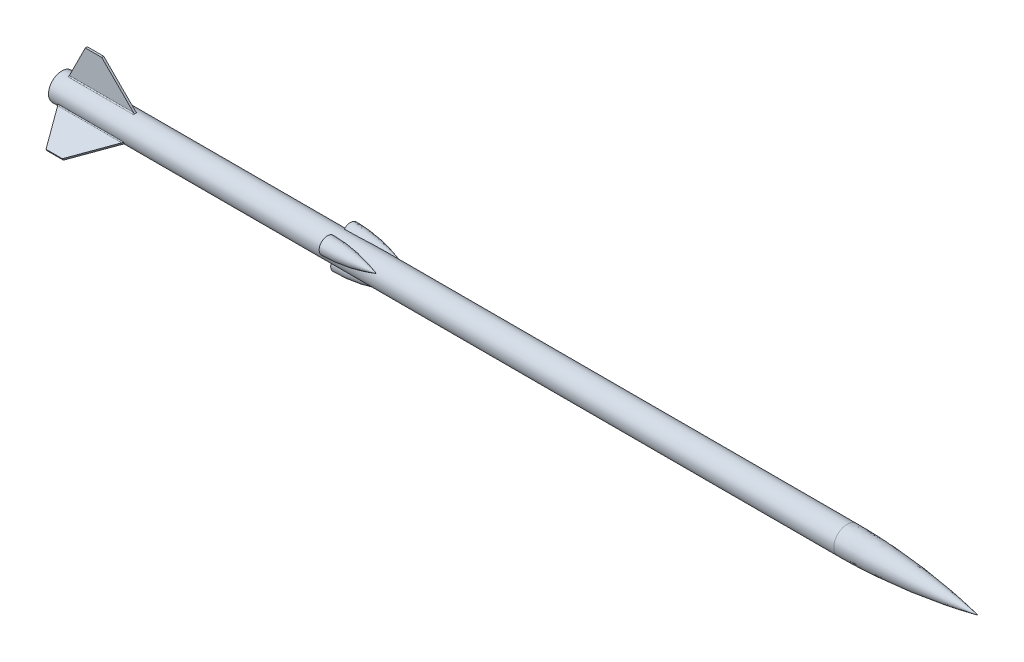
ISO-10303-21;
HEADER;
FILE_DESCRIPTION(('STEP AP214'),'2;1');
FILE_NAME('part.step','',(''),(''),'','','');
FILE_SCHEMA(('AUTOMOTIVE_DESIGN { 1 0 10303 214 1 1 1 1 }'));
ENDSEC;
DATA;
#1=APPLICATION_CONTEXT('core data for automotive mechanical design processes');
#2=APPLICATION_PROTOCOL_DEFINITION('international standard','automotive_design',2000,#1);
#3=PRODUCT_CONTEXT('',#1,'mechanical');
#4=PRODUCT('Part','Part','',(#3));
#5=PRODUCT_RELATED_PRODUCT_CATEGORY('part','',(#4));
#6=PRODUCT_DEFINITION_FORMATION('','',#4);
#7=PRODUCT_DEFINITION_CONTEXT('part definition',#1,'design');
#8=PRODUCT_DEFINITION('design','',#6,#7);
#9=PRODUCT_DEFINITION_SHAPE('','',#8);
#10=(LENGTH_UNIT() NAMED_UNIT(*) SI_UNIT(.MILLI.,.METRE.));
#11=(NAMED_UNIT(*) PLANE_ANGLE_UNIT() SI_UNIT($,.RADIAN.));
#12=(NAMED_UNIT(*) SI_UNIT($,.STERADIAN.) SOLID_ANGLE_UNIT());
#13=UNCERTAINTY_MEASURE_WITH_UNIT(LENGTH_MEASURE(1.E-05),#10,'distance_accuracy_value','');
#14=(GEOMETRIC_REPRESENTATION_CONTEXT(3) GLOBAL_UNCERTAINTY_ASSIGNED_CONTEXT((#13)) GLOBAL_UNIT_ASSIGNED_CONTEXT((#10,
#11,#12)) REPRESENTATION_CONTEXT('',''));
#15=CARTESIAN_POINT('',(0.,0.,0.));
#16=DIRECTION('',(0.,0.,1.));
#17=DIRECTION('',(1.,0.,0.));
#18=AXIS2_PLACEMENT_3D('',#15,#16,#17);
#19=CARTESIAN_POINT('',(0.,0.,0.));
#20=DIRECTION('',(1.,0.,0.));
#21=DIRECTION('',(0.,0.,-1.));
#22=AXIS2_PLACEMENT_3D('',#19,#20,#21);
#23=PLANE('',#22);
#24=CARTESIAN_POINT('',(0.,0.,0.));
#25=DIRECTION('',(1.,0.,0.));
#26=DIRECTION('',(0.,0.,-1.));
#27=AXIS2_PLACEMENT_3D('',#24,#25,#26);
#28=CIRCLE('',#27,6.8834);
#29=CARTESIAN_POINT('',(0.,0.,-6.8834));
#30=VERTEX_POINT('',#29);
#31=EDGE_CURVE('E370',#30,#30,#28,.T.);
#32=ORIENTED_EDGE('',*,*,#31,.F.);
#33=EDGE_LOOP('',(#32));
#34=FACE_BOUND('',#33,.T.);
#35=CARTESIAN_POINT('',(0.,0.,0.));
#36=DIRECTION('',(1.,0.,0.));
#37=DIRECTION('',(0.,0.,-1.));
#38=AXIS2_PLACEMENT_3D('',#35,#36,#37);
#39=CIRCLE('',#38,2.38125);
#40=CARTESIAN_POINT('',(0.,0.,-2.38125));
#41=VERTEX_POINT('',#40);
#42=EDGE_CURVE('E282',#41,#41,#39,.T.);
#43=ORIENTED_EDGE('',*,*,#42,.T.);
#44=EDGE_LOOP('',(#43));
#45=FACE_BOUND('',#44,.T.);
#46=ADVANCED_FACE('F31',(#34,#45),#23,.F.);
#47=CARTESIAN_POINT('',(406.4,0.,0.));
#48=DIRECTION('',(-1.,0.,0.));
#49=DIRECTION('',(0.,0.,1.));
#50=AXIS2_PLACEMENT_3D('',#47,#48,#49);
#51=CYLINDRICAL_SURFACE('',#50,6.8834);
#52=CARTESIAN_POINT('',(168.785993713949,3.44170000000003,-5.96119926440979));
#53=CARTESIAN_POINT('',(168.785896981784,3.44167127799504,-5.9612158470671));
#54=CARTESIAN_POINT('',(168.785800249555,3.44164255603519,-5.96123242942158));
#55=CARTESIAN_POINT('',(168.785640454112,3.44159510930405,-5.96125982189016));
#56=CARTESIAN_POINT('',(168.785577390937,3.4415763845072,-5.96127063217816));
#57=CARTESIAN_POINT('',(168.785262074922,3.44148276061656,-5.96132468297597));
#58=CARTESIAN_POINT('',(168.785009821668,3.44140786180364,-5.96136792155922));
#59=CARTESIAN_POINT('',(168.783748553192,3.44103336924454,-5.96158410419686));
#60=CARTESIAN_POINT('',(168.782739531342,3.44073378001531,-5.96175701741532));
#61=CARTESIAN_POINT('',(168.77769438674,3.43923585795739,-5.9626214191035));
#62=CARTESIAN_POINT('',(168.773658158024,3.4380375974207,-5.96331241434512));
#63=CARTESIAN_POINT('',(168.753476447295,3.4320466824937,-5.96676476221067));
#64=CARTESIAN_POINT('',(168.737329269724,3.42725519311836,-5.9695182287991));
#65=CARTESIAN_POINT('',(168.656584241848,3.40330407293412,-5.98324365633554));
#66=CARTESIAN_POINT('',(168.59195934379,3.38416353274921,-5.99408983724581));
#67=CARTESIAN_POINT('',(168.397994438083,3.32680759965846,-6.02623167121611));
#68=CARTESIAN_POINT('',(168.26856841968,3.28865914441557,-6.04712988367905));
#69=CARTESIAN_POINT('',(168.009492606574,3.21257075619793,-6.08789347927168));
#70=CARTESIAN_POINT('',(167.879842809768,3.17463082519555,-6.10775885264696));
#71=CARTESIAN_POINT('',(167.230810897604,2.98546053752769,-6.20460625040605));
#72=CARTESIAN_POINT('',(166.709752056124,2.83601626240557,-6.27404239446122));
#73=CARTESIAN_POINT('',(165.925737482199,2.61597281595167,-6.36743500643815));
#74=CARTESIAN_POINT('',(165.663978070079,2.54330764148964,-6.39677381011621));
#75=CARTESIAN_POINT('',(165.139669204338,2.39952588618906,-6.45208524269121));
#76=CARTESIAN_POINT('',(164.877119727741,2.32840935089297,-6.47805777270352));
#77=CARTESIAN_POINT('',(164.086206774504,2.11707104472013,-6.55145165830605));
#78=CARTESIAN_POINT('',(163.55669586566,1.97945747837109,-6.5941006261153));
#79=CARTESIAN_POINT('',(162.494848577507,1.71233860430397,-6.6684565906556));
#80=CARTESIAN_POINT('',(161.962512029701,1.58283378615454,-6.70016292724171));
#81=CARTESIAN_POINT('',(160.895155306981,1.33286671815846,-6.75433345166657));
#82=CARTESIAN_POINT('',(160.360134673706,1.21240607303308,-6.77679600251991));
#83=CARTESIAN_POINT('',(159.287708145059,0.981319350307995,-6.81409620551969));
#84=CARTESIAN_POINT('',(158.750302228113,0.870693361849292,-6.82893378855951));
#85=CARTESIAN_POINT('',(157.672501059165,0.659725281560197,-6.85253546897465));
#86=CARTESIAN_POINT('',(157.132102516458,0.559398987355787,-6.86129035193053));
#87=CARTESIAN_POINT('',(156.049338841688,0.369697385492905,-6.87412235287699));
#88=CARTESIAN_POINT('',(155.506973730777,0.280321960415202,-6.87819952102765));
#89=CARTESIAN_POINT('',(154.420459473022,0.112878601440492,-6.88298413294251));
#90=CARTESIAN_POINT('',(153.876310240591,0.0348112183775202,-6.88369141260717));
#91=CARTESIAN_POINT('',(152.786447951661,-0.109745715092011,-6.88290464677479));
#92=CARTESIAN_POINT('',(152.24073481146,-0.176234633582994,-6.88141048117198));
#93=CARTESIAN_POINT('',(151.124345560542,-0.300058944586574,-6.87714808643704));
#94=CARTESIAN_POINT('',(150.553611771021,-0.35687328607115,-6.87432748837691));
#95=CARTESIAN_POINT('',(149.410987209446,-0.457529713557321,-6.8683625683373));
#96=CARTESIAN_POINT('',(148.839096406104,-0.501371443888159,-6.86521823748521));
#97=CARTESIAN_POINT('',(147.694403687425,-0.575983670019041,-6.85936147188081));
#98=CARTESIAN_POINT('',(147.121601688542,-0.606752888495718,-6.85664907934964));
#99=CARTESIAN_POINT('',(145.975442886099,-0.655152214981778,-6.85219396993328));
#100=CARTESIAN_POINT('',(145.402086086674,-0.672782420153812,-6.85045124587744));
#101=CARTESIAN_POINT('',(144.254731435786,-0.694879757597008,-6.84824513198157));
#102=CARTESIAN_POINT('',(143.68073341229,-0.699338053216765,-6.84778260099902));
#103=CARTESIAN_POINT('',(142.53278605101,-0.695058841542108,-6.84821825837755));
#104=CARTESIAN_POINT('',(141.958836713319,-0.686321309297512,-6.84911644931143));
#105=CARTESIAN_POINT('',(140.811311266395,-0.655665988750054,-6.85211898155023));
#106=CARTESIAN_POINT('',(140.237735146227,-0.633748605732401,-6.85422328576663));
#107=CARTESIAN_POINT('',(139.091240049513,-0.576774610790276,-6.85925241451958));
#108=CARTESIAN_POINT('',(138.518321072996,-0.541717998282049,-6.86217723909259));
#109=CARTESIAN_POINT('',(137.36966694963,-0.458264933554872,-6.8682567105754));
#110=CARTESIAN_POINT('',(136.793938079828,-0.409782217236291,-6.87141274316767));
#111=CARTESIAN_POINT('',(135.643733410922,-0.299697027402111,-6.87709340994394));
#112=CARTESIAN_POINT('',(135.069257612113,-0.238094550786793,-6.87961804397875));
#113=CARTESIAN_POINT('',(133.92183655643,-0.101948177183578,-6.8829817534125));
#114=CARTESIAN_POINT('',(133.348891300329,-0.0274042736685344,-6.8838208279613));
#115=CARTESIAN_POINT('',(132.204797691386,0.134368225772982,-6.88256362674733));
#116=CARTESIAN_POINT('',(131.633649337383,0.221596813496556,-6.88046735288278));
#117=CARTESIAN_POINT('',(130.493736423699,0.408328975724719,-6.87191337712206));
#118=CARTESIAN_POINT('',(129.92497066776,0.507825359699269,-6.86545822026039));
#119=CARTESIAN_POINT('',(128.789740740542,0.718649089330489,-6.84660007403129));
#120=CARTESIAN_POINT('',(128.223276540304,0.829976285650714,-6.83419715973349));
#121=CARTESIAN_POINT('',(127.092812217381,1.06385853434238,-6.80171762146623));
#122=CARTESIAN_POINT('',(126.528812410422,1.18641498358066,-6.78164004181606));
#123=CARTESIAN_POINT('',(125.403558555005,1.44189316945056,-6.73193751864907));
#124=CARTESIAN_POINT('',(124.842304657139,1.57481546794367,-6.70231205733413));
#125=CARTESIAN_POINT('',(124.282559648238,1.71248857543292,-6.66697670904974));
#126=B_SPLINE_CURVE_WITH_KNOTS('',3,(#52,#53,#54,#55,#56,#57,#58,#59,#60,#61,#62,#63,#64,#65,
#66,#67,#68,#69,#70,#71,#72,#73,#74,#75,#76,#77,#78,#79,#80,#81,#82,#83,#84,#85,#86,#87,#88,#89,
#90,#91,#92,#93,#94,#95,#96,#97,#98,#99,#100,#101,#102,#103,#104,#105,#106,#107,#108,#109,#110,
#111,#112,#113,#114,#115,#116,#117,#118,#119,#120,#121,#122,#123,#124,#125),.UNSPECIFIED.,.F.,
.F.,(4,2,2,2,2,2,2,2,2,2,2,2,2,2,2,2,2,2,2,2,2,2,2,2,2,2,2,2,2,2,2,2,2,2,2,2,4),(0.,
0.000306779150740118,0.000506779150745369,0.0013067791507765,0.00450677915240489,
0.0173067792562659,0.068506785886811,0.273307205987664,0.682921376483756,1.09253941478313,
2.73172035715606,3.55141578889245,4.37113529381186,6.01721296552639,7.66338992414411,
9.30985827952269,10.9563415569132,12.6053136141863,14.2542679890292,15.9033026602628,
17.5524273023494,19.2729639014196,20.9935476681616,22.7142995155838,24.435038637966,
26.1569318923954,27.8788284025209,29.6006719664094,31.3225156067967,33.0556897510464,
34.7888643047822,36.5220397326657,38.2552140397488,39.9873772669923,41.7195186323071,
43.451875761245,45.184326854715),.UNSPECIFIED.);
#127=CARTESIAN_POINT('',(168.785993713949,3.44170000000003,-5.96119926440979));
#128=VERTEX_POINT('',#127);
#129=CARTESIAN_POINT('',(143.385993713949,-0.697718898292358,-6.84794742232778));
#130=VERTEX_POINT('',#129);
#131=EDGE_CURVE('E272',#128,#130,#126,.T.);
#132=ORIENTED_EDGE('',*,*,#131,.F.);
#133=CARTESIAN_POINT('',(168.785993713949,3.44170000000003,-5.96119926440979));
#134=CARTESIAN_POINT('',(168.785896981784,3.44172872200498,-5.9611826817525));
#135=CARTESIAN_POINT('',(168.785800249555,3.44175744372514,-5.96116609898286));
#136=CARTESIAN_POINT('',(168.785640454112,3.44180488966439,-5.96113870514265));
#137=CARTESIAN_POINT('',(168.785577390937,3.44182361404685,-5.96112789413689));
#138=CARTESIAN_POINT('',(168.785262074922,3.4419172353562,-5.96107383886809));
#139=CARTESIAN_POINT('',(168.785009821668,3.44199213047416,-5.96103059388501));
#140=CARTESIAN_POINT('',(168.783748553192,3.44236659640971,-5.96081436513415));
#141=CARTESIAN_POINT('',(168.782739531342,3.44266613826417,-5.96064136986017));
#142=CARTESIAN_POINT('',(168.77769438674,3.44416369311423,-5.95977633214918));
#143=CARTESIAN_POINT('',(168.773658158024,3.4453612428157,-5.95908410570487));
#144=CARTESIAN_POINT('',(168.753476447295,3.45134652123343,-5.95562199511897));
#145=CARTESIAN_POINT('',(168.737329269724,3.45612683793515,-5.95284917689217));
#146=CARTESIAN_POINT('',(168.656584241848,3.47998896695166,-5.93896961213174));
#147=CARTESIAN_POINT('',(168.59195934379,3.49895230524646,-5.92781650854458));
#148=CARTESIAN_POINT('',(168.397994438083,3.55546591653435,-5.89421573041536));
#149=CARTESIAN_POINT('',(168.26856841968,3.59263852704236,-5.87162730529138));
#150=CARTESIAN_POINT('',(168.009492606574,3.66598503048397,-5.82611462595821));
#151=CARTESIAN_POINT('',(167.879842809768,3.70215891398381,-5.80319036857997));
#152=CARTESIAN_POINT('',(167.230810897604,3.88061636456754,-5.68778779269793));
#153=CARTESIAN_POINT('',(166.709752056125,4.0154719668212,-5.59308332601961));
#154=CARTESIAN_POINT('',(165.925737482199,4.20637406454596,-5.44921641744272));
#155=CARTESIAN_POINT('',(165.663978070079,4.26811480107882,-5.4009559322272));
#156=CARTESIAN_POINT('',(165.139669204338,4.38790678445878,-5.30409299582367));
#157=CARTESIAN_POINT('',(164.877119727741,4.44595792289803,-5.25549053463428));
#158=CARTESIAN_POINT('',(164.086206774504,4.6151880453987,-5.10916313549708));
#159=CARTESIAN_POINT('',(163.55669586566,4.72092991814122,-5.01131077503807));
#160=CARTESIAN_POINT('',(162.494848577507,4.91888350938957,-4.81715702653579));
#161=CARTESIAN_POINT('',(161.962512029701,5.01109441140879,-4.72085573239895));
#162=CARTESIAN_POINT('',(160.895155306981,5.18299099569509,-4.53146316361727));
#163=CARTESIAN_POINT('',(160.360134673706,5.26267445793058,-4.43837246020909));
#164=CARTESIAN_POINT('',(159.287708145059,5.41052074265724,-4.25689558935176));
#165=CARTESIAN_POINT('',(158.750302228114,5.47868346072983,-4.16850946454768));
#166=CARTESIAN_POINT('',(157.672501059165,5.60460715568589,-3.99760658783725));
#167=CARTESIAN_POINT('',(157.132102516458,5.66235225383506,-3.91509890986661));
#168=CARTESIAN_POINT('',(156.049338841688,5.76831589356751,-3.75722850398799));
#169=CARTESIAN_POINT('',(155.506973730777,5.81653453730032,-3.68186569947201));
#170=CARTESIAN_POINT('',(154.420459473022,5.9043998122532,-3.53924780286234));
#171=CARTESIAN_POINT('',(153.876310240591,5.94404602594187,-3.47199310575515));
#172=CARTESIAN_POINT('',(152.786447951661,6.01564313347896,-3.34640974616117));
#173=CARTESIAN_POINT('',(152.240734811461,6.04759360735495,-3.28808157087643));
#174=CARTESIAN_POINT('',(151.124345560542,6.10581442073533,-3.17871537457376));
#175=CARTESIAN_POINT('',(150.553611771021,6.13177888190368,-3.12810241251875));
#176=CARTESIAN_POINT('',(149.410987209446,6.17694132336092,-3.03794892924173));
#177=CARTESIAN_POINT('',(148.839096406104,6.19613911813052,-2.99840871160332));
#178=CARTESIAN_POINT('',(147.694403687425,6.22837312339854,-2.93086424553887));
#179=CARTESIAN_POINT('',(147.121601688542,6.24140873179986,-2.90286112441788));
#180=CARTESIAN_POINT('',(145.975442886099,6.26175015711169,-2.85871852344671));
#181=CARTESIAN_POINT('',(145.402086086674,6.26905601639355,-2.84257895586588));
#182=CARTESIAN_POINT('',(144.254731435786,6.27819413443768,-2.82233904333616));
#183=CARTESIAN_POINT('',(143.68073341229,6.28002271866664,-2.8182467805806));
#184=CARTESIAN_POINT('',(142.532786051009,6.27826040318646,-2.82217051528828));
#185=CARTESIAN_POINT('',(141.958836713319,6.27466949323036,-2.83018653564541));
#186=CARTESIAN_POINT('',(140.811311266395,6.2619421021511,-2.85823608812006));
#187=CARTESIAN_POINT('',(140.237735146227,6.25280579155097,-2.87826925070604));
#188=CARTESIAN_POINT('',(139.091240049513,6.22867414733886,-2.9301247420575));
#189=CARTESIAN_POINT('',(138.518321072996,6.21367881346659,-2.96194707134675));
#190=CARTESIAN_POINT('',(137.369666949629,6.1772172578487,-3.03725928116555));
#191=CARTESIAN_POINT('',(136.793938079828,6.15570910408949,-3.08082456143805));
#192=CARTESIAN_POINT('',(135.643733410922,6.10558611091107,-3.17900146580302));
#193=CARTESIAN_POINT('',(135.069257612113,6.07697126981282,-3.23361309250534));
#194=CARTESIAN_POINT('',(133.92183655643,6.01181114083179,-3.35320116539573));
#195=CARTESIAN_POINT('',(133.348891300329,5.9752658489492,-3.4181776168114));
#196=CARTESIAN_POINT('',(132.204797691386,5.89329083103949,-3.55764811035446));
#197=CARTESIAN_POINT('',(131.633649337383,5.84786111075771,-3.63214214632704));
#198=CARTESIAN_POINT('',(130.493736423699,5.74708706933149,-3.78957995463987));
#199=CARTESIAN_POINT('',(129.92497066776,5.6917485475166,-3.87251877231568));
#200=CARTESIAN_POINT('',(128.789740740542,5.57000504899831,-4.04566840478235));
#201=CARTESIAN_POINT('',(128.223276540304,5.50360021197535,-4.13587912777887));
#202=CARTESIAN_POINT('',(127.092812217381,5.35853098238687,-4.32218732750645));
#203=CARTESIAN_POINT('',(126.528812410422,5.27986506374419,-4.41828553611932));
#204=CARTESIAN_POINT('',(125.403558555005,5.10908232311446,-4.61468487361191));
#205=CARTESIAN_POINT('',(124.842304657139,5.01696477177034,-4.71498623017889));
#206=CARTESIAN_POINT('',(124.282559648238,4.91752690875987,-4.81654696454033));
#207=B_SPLINE_CURVE_WITH_KNOTS('',3,(#133,#134,#135,#136,#137,#138,#139,#140,#141,#142,#143,
#144,#145,#146,#147,#148,#149,#150,#151,#152,#153,#154,#155,#156,#157,#158,#159,#160,#161,#162,
#163,#164,#165,#166,#167,#168,#169,#170,#171,#172,#173,#174,#175,#176,#177,#178,#179,#180,#181,
#182,#183,#184,#185,#186,#187,#188,#189,#190,#191,#192,#193,#194,#195,#196,#197,#198,#199,#200,
#201,#202,#203,#204,#205,#206),.UNSPECIFIED.,.F.,.F.,(4,2,2,2,2,2,2,2,2,2,2,2,2,2,2,2,2,2,2,2,2,
2,2,2,2,2,2,2,2,2,2,2,2,2,2,2,4),(0.,0.000306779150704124,0.000506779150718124,
0.0013067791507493,0.00450677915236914,0.0173067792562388,0.0685067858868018,0.273307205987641,
0.682921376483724,1.0925394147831,2.73172035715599,3.55141578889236,4.37113529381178,
6.01721296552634,7.66338992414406,9.30985827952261,10.9563415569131,12.6053136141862,
14.2542679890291,15.9033026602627,17.5524273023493,19.2729639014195,20.9935476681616,
22.7142995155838,24.435038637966,26.1569318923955,27.878828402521,29.6006719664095,
31.3225156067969,33.0556897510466,34.7888643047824,36.5220397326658,38.2552140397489,
39.9873772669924,41.7195186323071,43.4518757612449,45.184326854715),.UNSPECIFIED.);
#208=CARTESIAN_POINT('',(143.385993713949,6.27935588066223,-2.81973142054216));
#209=VERTEX_POINT('',#208);
#210=EDGE_CURVE('E1032',#209,#128,#207,.F.);
#211=ORIENTED_EDGE('',*,*,#210,.F.);
#212=CARTESIAN_POINT('',(143.385993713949,0.,0.));
#213=DIRECTION('',(1.,0.,0.));
#214=DIRECTION('',(0.,0.,-1.));
#215=AXIS2_PLACEMENT_3D('',#212,#213,#214);
#216=CIRCLE('',#215,6.8834);
#217=EDGE_CURVE('E1029',#130,#209,#216,.T.);
#218=ORIENTED_EDGE('',*,*,#217,.F.);
#219=EDGE_LOOP('',(#132,#211,#218));
#220=FACE_BOUND('',#219,.T.);
#221=ORIENTED_EDGE('',*,*,#31,.T.);
#222=EDGE_LOOP('',(#221));
#223=FACE_BOUND('',#222,.T.);
#224=CARTESIAN_POINT('',(406.4,0.,0.));
#225=DIRECTION('',(1.,0.,0.));
#226=DIRECTION('',(0.,0.,-1.));
#227=AXIS2_PLACEMENT_3D('',#224,#225,#226);
#228=CIRCLE('',#227,6.8834);
#229=CARTESIAN_POINT('',(406.4,0.,-6.8834));
#230=VERTEX_POINT('',#229);
#231=EDGE_CURVE('E373',#230,#230,#228,.T.);
#232=ORIENTED_EDGE('',*,*,#231,.F.);
#233=EDGE_LOOP('',(#232));
#234=FACE_BOUND('',#233,.T.);
#235=CARTESIAN_POINT('',(4.23333333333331,0.,0.));
#236=DIRECTION('',(1.,0.,0.));
#237=DIRECTION('',(0.,0.,-1.));
#238=AXIS2_PLACEMENT_3D('',#235,#236,#237);
#239=CIRCLE('',#238,6.8834);
#240=CARTESIAN_POINT('',(4.23333333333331,6.81288018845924,-0.982781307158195));
#241=VERTEX_POINT('',#240);
#242=CARTESIAN_POINT('',(4.23333333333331,6.86487124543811,-0.504716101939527));
#243=VERTEX_POINT('',#242);
#244=EDGE_CURVE('E376',#241,#243,#239,.T.);
#245=ORIENTED_EDGE('',*,*,#244,.F.);
#246=DIRECTION('',(-1.,0.,0.));
#247=VECTOR('',#246,1.);
#248=CARTESIAN_POINT('',(406.4,6.81288018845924,-0.982781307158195));
#249=LINE('',#248,#247);
#250=CARTESIAN_POINT('',(38.1,6.81288018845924,-0.982781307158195));
#251=VERTEX_POINT('',#250);
#252=EDGE_CURVE('E625',#241,#251,#249,.F.);
#253=ORIENTED_EDGE('',*,*,#252,.T.);
#254=CARTESIAN_POINT('',(38.1,0.,0.));
#255=DIRECTION('',(-1.,0.,0.));
#256=DIRECTION('',(0.,0.,1.));
#257=AXIS2_PLACEMENT_3D('',#254,#255,#256);
#258=CIRCLE('',#257,6.8834);
#259=CARTESIAN_POINT('',(38.1,6.86487120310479,-0.504716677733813));
#260=VERTEX_POINT('',#259);
#261=EDGE_CURVE('E383',#260,#251,#258,.T.);
#262=ORIENTED_EDGE('',*,*,#261,.F.);
#263=CARTESIAN_POINT('',(44.9648712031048,0.,0.));
#264=DIRECTION('',(-0.707106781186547,-0.707106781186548,0.));
#265=DIRECTION('',(-0.707106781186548,0.707106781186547,0.));
#266=AXIS2_PLACEMENT_3D('',#263,#264,#265);
#267=ELLIPSE('',#266,9.73459763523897,6.8834);
#268=CARTESIAN_POINT('',(38.1,6.86487120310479,0.504716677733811));
#269=VERTEX_POINT('',#268);
#270=EDGE_CURVE('E386',#269,#260,#267,.T.);
#271=ORIENTED_EDGE('',*,*,#270,.F.);
#272=CARTESIAN_POINT('',(38.1,6.81288018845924,0.982781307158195));
#273=VERTEX_POINT('',#272);
#274=EDGE_CURVE('E385',#273,#269,#258,.T.);
#275=ORIENTED_EDGE('',*,*,#274,.F.);
#276=DIRECTION('',(-1.,0.,0.));
#277=VECTOR('',#276,1.);
#278=CARTESIAN_POINT('',(406.4,6.81288018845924,0.982781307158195));
#279=LINE('',#278,#277);
#280=CARTESIAN_POINT('',(4.23333333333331,6.81288018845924,0.982781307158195));
#281=VERTEX_POINT('',#280);
#282=EDGE_CURVE('E606',#273,#281,#279,.T.);
#283=ORIENTED_EDGE('',*,*,#282,.T.);
#284=CARTESIAN_POINT('',(4.23333333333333,6.86487124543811,0.50471610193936));
#285=VERTEX_POINT('',#284);
#286=EDGE_CURVE('E380',#285,#281,#239,.T.);
#287=ORIENTED_EDGE('',*,*,#286,.F.);
#288=CARTESIAN_POINT('',(0.800897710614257,0.,0.));
#289=DIRECTION('',(0.894427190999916,-0.447213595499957,0.));
#290=DIRECTION('',(-0.447213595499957,-0.894427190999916,0.));
#291=AXIS2_PLACEMENT_3D('',#288,#289,#290);
#292=ELLIPSE('',#291,7.69587515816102,6.8834);
#293=EDGE_CURVE('E379',#243,#285,#292,.T.);
#294=ORIENTED_EDGE('',*,*,#293,.F.);
#295=EDGE_LOOP('',(#245,#253,#262,#271,#275,#283,#287,#294));
#296=FACE_BOUND('',#295,.T.);
#297=DIRECTION('',(-1.,0.,0.));
#298=VECTOR('',#297,1.);
#299=CARTESIAN_POINT('',(406.4,-4.25755367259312,5.4087366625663));
#300=LINE('',#299,#298);
#301=CARTESIAN_POINT('',(38.1,-4.25755367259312,5.4087366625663));
#302=VERTEX_POINT('',#301);
#303=CARTESIAN_POINT('',(4.23333333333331,-4.25755367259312,5.4087366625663));
#304=VERTEX_POINT('',#303);
#305=EDGE_CURVE('E655',#302,#304,#300,.T.);
#306=ORIENTED_EDGE('',*,*,#305,.T.);
#307=CARTESIAN_POINT('',(4.23333333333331,0.,0.));
#308=DIRECTION('',(1.,0.,0.));
#309=DIRECTION('',(0.,0.,-1.));
#310=AXIS2_PLACEMENT_3D('',#307,#308,#309);
#311=CIRCLE('',#310,6.8834);
#312=CARTESIAN_POINT('',(4.23333333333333,-3.86953258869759,5.69279484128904));
#313=VERTEX_POINT('',#312);
#314=EDGE_CURVE('E393',#313,#304,#311,.T.);
#315=ORIENTED_EDGE('',*,*,#314,.F.);
#316=CARTESIAN_POINT('',(0.800897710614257,0.,0.));
#317=DIRECTION('',(0.894427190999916,0.22360679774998,-0.38729833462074));
#318=DIRECTION('',(-0.447213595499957,0.447213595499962,-0.774596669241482));
#319=AXIS2_PLACEMENT_3D('',#316,#317,#318);
#320=ELLIPSE('',#319,7.69587515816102,6.8834);
#321=CARTESIAN_POINT('',(4.23333333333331,-2.9953386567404,6.19751094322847));
#322=VERTEX_POINT('',#321);
#323=EDGE_CURVE('E392',#322,#313,#320,.T.);
#324=ORIENTED_EDGE('',*,*,#323,.F.);
#325=CARTESIAN_POINT('',(4.23333333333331,-2.55532651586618,6.3915179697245));
#326=VERTEX_POINT('',#325);
#327=EDGE_CURVE('E389',#326,#322,#311,.T.);
#328=ORIENTED_EDGE('',*,*,#327,.F.);
#329=DIRECTION('',(-1.,0.,0.));
#330=VECTOR('',#329,1.);
#331=CARTESIAN_POINT('',(406.4,-2.55532651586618,6.3915179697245));
#332=LINE('',#331,#330);
#333=CARTESIAN_POINT('',(38.1,-2.55532651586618,6.3915179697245));
#334=VERTEX_POINT('',#333);
#335=EDGE_CURVE('E592',#326,#334,#332,.F.);
#336=ORIENTED_EDGE('',*,*,#335,.T.);
#337=CARTESIAN_POINT('',(38.1,0.,0.));
#338=DIRECTION('',(-1.,0.,0.));
#339=DIRECTION('',(0.,0.,1.));
#340=AXIS2_PLACEMENT_3D('',#337,#338,#339);
#341=CIRCLE('',#340,6.8834);
#342=CARTESIAN_POINT('',(38.1,-2.99533813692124,6.19751119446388));
#343=VERTEX_POINT('',#342);
#344=EDGE_CURVE('E396',#343,#334,#341,.T.);
#345=ORIENTED_EDGE('',*,*,#344,.F.);
#346=CARTESIAN_POINT('',(44.9648712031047,0.,0.));
#347=DIRECTION('',(-0.707106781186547,0.353553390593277,-0.612372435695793));
#348=DIRECTION('',(-0.707106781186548,-0.353553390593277,0.612372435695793));
#349=AXIS2_PLACEMENT_3D('',#346,#347,#348);
#350=ELLIPSE('',#349,9.73459763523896,6.8834);
#351=CARTESIAN_POINT('',(38.1,-3.86953306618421,5.69279451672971));
#352=VERTEX_POINT('',#351);
#353=EDGE_CURVE('E399',#352,#343,#350,.T.);
#354=ORIENTED_EDGE('',*,*,#353,.F.);
#355=EDGE_CURVE('E398',#302,#352,#341,.T.);
#356=ORIENTED_EDGE('',*,*,#355,.F.);
#357=EDGE_LOOP('',(#306,#315,#324,#328,#336,#345,#354,#356));
#358=FACE_BOUND('',#357,.T.);
#359=CARTESIAN_POINT('',(4.23333333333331,0.,0.));
#360=DIRECTION('',(1.,0.,0.));
#361=DIRECTION('',(0.,0.,-1.));
#362=AXIS2_PLACEMENT_3D('',#359,#360,#361);
#363=CIRCLE('',#362,6.8834);
#364=CARTESIAN_POINT('',(4.23333333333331,-4.25755367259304,-5.40873666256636));
#365=VERTEX_POINT('',#364);
#366=CARTESIAN_POINT('',(4.23333333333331,-3.86953258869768,-5.692794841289));
#367=VERTEX_POINT('',#366);
#368=EDGE_CURVE('E402',#365,#367,#363,.T.);
#369=ORIENTED_EDGE('',*,*,#368,.F.);
#370=DIRECTION('',(-1.,0.,0.));
#371=VECTOR('',#370,1.);
#372=CARTESIAN_POINT('',(406.4,-4.25755367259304,-5.40873666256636));
#373=LINE('',#372,#371);
#374=CARTESIAN_POINT('',(38.1,-4.25755367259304,-5.40873666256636));
#375=VERTEX_POINT('',#374);
#376=EDGE_CURVE('E674',#365,#375,#373,.F.);
#377=ORIENTED_EDGE('',*,*,#376,.T.);
#378=CARTESIAN_POINT('',(38.1,0.,0.));
#379=DIRECTION('',(-1.,0.,0.));
#380=DIRECTION('',(0.,0.,1.));
#381=AXIS2_PLACEMENT_3D('',#378,#379,#380);
#382=CIRCLE('',#381,6.8834);
#383=CARTESIAN_POINT('',(38.1,-3.8695330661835,-5.69279451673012));
#384=VERTEX_POINT('',#383);
#385=EDGE_CURVE('E408',#384,#375,#382,.T.);
#386=ORIENTED_EDGE('',*,*,#385,.F.);
#387=CARTESIAN_POINT('',(44.9648712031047,0.,0.));
#388=DIRECTION('',(-0.707106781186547,0.353553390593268,0.612372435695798));
#389=DIRECTION('',(-0.707106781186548,-0.353553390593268,-0.612372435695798));
#390=AXIS2_PLACEMENT_3D('',#387,#388,#389);
#391=ELLIPSE('',#390,9.73459763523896,6.8834);
#392=CARTESIAN_POINT('',(38.1,-2.99533813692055,-6.19751119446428));
#393=VERTEX_POINT('',#392);
#394=EDGE_CURVE('E411',#393,#384,#391,.T.);
#395=ORIENTED_EDGE('',*,*,#394,.F.);
#396=CARTESIAN_POINT('',(38.1,-2.55532651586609,-6.39151796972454));
#397=VERTEX_POINT('',#396);
#398=EDGE_CURVE('E410',#397,#393,#382,.T.);
#399=ORIENTED_EDGE('',*,*,#398,.F.);
#400=DIRECTION('',(-1.,0.,0.));
#401=VECTOR('',#400,1.);
#402=CARTESIAN_POINT('',(406.4,-2.55532651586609,-6.39151796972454));
#403=LINE('',#402,#401);
#404=CARTESIAN_POINT('',(4.23333333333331,-2.55532651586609,-6.39151796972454));
#405=VERTEX_POINT('',#404);
#406=EDGE_CURVE('E639',#397,#405,#403,.T.);
#407=ORIENTED_EDGE('',*,*,#406,.T.);
#408=CARTESIAN_POINT('',(4.23333333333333,-2.99533865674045,-6.19751094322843));
#409=VERTEX_POINT('',#408);
#410=EDGE_CURVE('E405',#409,#405,#363,.T.);
#411=ORIENTED_EDGE('',*,*,#410,.F.);
#412=CARTESIAN_POINT('',(0.800897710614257,0.,0.));
#413=DIRECTION('',(0.894427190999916,0.223606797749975,0.387298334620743));
#414=DIRECTION('',(-0.447213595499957,0.447213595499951,0.774596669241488));
#415=AXIS2_PLACEMENT_3D('',#412,#413,#414);
#416=ELLIPSE('',#415,7.69587515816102,6.8834);
#417=EDGE_CURVE('E404',#367,#409,#416,.T.);
#418=ORIENTED_EDGE('',*,*,#417,.F.);
#419=EDGE_LOOP('',(#369,#377,#386,#395,#399,#407,#411,#418));
#420=FACE_BOUND('',#419,.T.);
#421=CARTESIAN_POINT('',(168.785993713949,-6.8834,0.));
#422=CARTESIAN_POINT('',(168.785896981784,-6.8834,3.31653145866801E-05));
#423=CARTESIAN_POINT('',(168.785800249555,-6.88339999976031,6.63304387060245E-05));
#424=CARTESIAN_POINT('',(168.785640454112,-6.8833999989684,0.000121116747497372));
#425=CARTESIAN_POINT('',(168.785577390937,-6.88339999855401,0.000142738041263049));
#426=CARTESIAN_POINT('',(168.785262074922,-6.88339999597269,0.00025084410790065));
#427=CARTESIAN_POINT('',(168.785009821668,-6.88339999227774,0.000337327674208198));
#428=CARTESIAN_POINT('',(168.783748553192,-6.88339996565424,0.000769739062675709));
#429=CARTESIAN_POINT('',(168.782739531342,-6.88339991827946,0.00111564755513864));
#430=CARTESIAN_POINT('',(168.77769438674,-6.88339955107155,0.00284508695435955));
#431=CARTESIAN_POINT('',(168.773658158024,-6.88339884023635,0.00422830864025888));
#432=CARTESIAN_POINT('',(168.753476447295,-6.8833932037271,0.0111427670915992));
#433=CARTESIAN_POINT('',(168.737329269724,-6.88338203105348,0.0166690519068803));
#434=CARTESIAN_POINT('',(168.656584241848,-6.88329303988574,0.0442740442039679));
#435=CARTESIAN_POINT('',(168.591959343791,-6.88311583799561,0.0662733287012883));
#436=CARTESIAN_POINT('',(168.397994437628,-6.88227351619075,0.132015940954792));
#437=CARTESIAN_POINT('',(168.26856841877,-6.88129767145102,0.175502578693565));
#438=CARTESIAN_POINT('',(168.009492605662,-6.87855578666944,0.261778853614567));
#439=CARTESIAN_POINT('',(167.879842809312,-6.87678973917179,0.304568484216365));
#440=CARTESIAN_POINT('',(167.230810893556,-6.86607690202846,0.516818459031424));
#441=CARTESIAN_POINT('',(166.709752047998,-6.85148822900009,0.680959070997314));
#442=CARTESIAN_POINT('',(165.925737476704,-6.82234688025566,0.918218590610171));
#443=CARTESIAN_POINT('',(165.663978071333,-6.81142244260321,0.995817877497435));
#444=CARTESIAN_POINT('',(165.139669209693,-6.78743267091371,1.14799224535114));
#445=CARTESIAN_POINT('',(164.87711973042,-6.77436727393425,1.22256723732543));
#446=CARTESIAN_POINT('',(164.086207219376,-6.73225911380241,1.4422883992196));
#447=CARTESIAN_POINT('',(163.556696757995,-6.70038745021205,1.58278961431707));
#448=CARTESIAN_POINT('',(162.494850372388,-6.63122223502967,1.85129912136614));
#449=CARTESIAN_POINT('',(161.962514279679,-6.59392835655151,1.97930665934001));
#450=CARTESIAN_POINT('',(160.895158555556,-6.51585795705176,2.22286956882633));
#451=CARTESIAN_POINT('',(160.360138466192,-6.47508082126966,2.33842273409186));
#452=CARTESIAN_POINT('',(159.287713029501,-6.39184047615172,2.55719965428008));
#453=CARTESIAN_POINT('',(158.750307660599,-6.34937725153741,2.66042329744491));
#454=CARTESIAN_POINT('',(157.672506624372,-6.26433287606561,2.85492792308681));
#455=CARTESIAN_POINT('',(157.132107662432,-6.22175164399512,2.94619059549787));
#456=CARTESIAN_POINT('',(156.049343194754,-6.13801361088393,3.11689319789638));
#457=CARTESIAN_POINT('',(155.506977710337,-6.09685679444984,3.19633325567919));
#458=CARTESIAN_POINT('',(154.420462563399,-6.01727863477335,3.34373593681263));
#459=CARTESIAN_POINT('',(153.876312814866,-5.97885742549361,3.4116979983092));
#460=CARTESIAN_POINT('',(152.786449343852,-5.9058975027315,3.53649475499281));
#461=CARTESIAN_POINT('',(152.240735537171,-5.87135900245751,3.5933288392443));
#462=CARTESIAN_POINT('',(151.122689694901,-5.80565818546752,3.69858860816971));
#463=CARTESIAN_POINT('',(150.550295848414,-5.77472643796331,3.74650270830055));
#464=CARTESIAN_POINT('',(149.404345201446,-5.71910729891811,3.8308694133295));
#465=CARTESIAN_POINT('',(148.830788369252,-5.69442008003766,3.86732170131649));
#466=CARTESIAN_POINT('',(147.682759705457,-5.65199909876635,3.92905912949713));
#467=CARTESIAN_POINT('',(147.108287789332,-5.63426602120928,3.95434316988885));
#468=CARTESIAN_POINT('',(145.958788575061,-5.60625583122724,3.99395543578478));
#469=CARTESIAN_POINT('',(145.383761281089,-5.59597866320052,4.00828374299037));
#470=CARTESIAN_POINT('',(144.233062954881,-5.5831607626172,4.02611878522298));
#471=CARTESIAN_POINT('',(143.657391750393,-5.58062527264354,4.02961818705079));
#472=CARTESIAN_POINT('',(142.506102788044,-5.58337554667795,4.02580656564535));
#473=CARTESIAN_POINT('',(141.930485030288,-5.58866132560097,4.01849552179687));
#474=CARTESIAN_POINT('',(140.7796302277,-5.60690781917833,3.992997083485));
#475=CARTESIAN_POINT('',(140.204393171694,-5.61986829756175,3.97481002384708));
#476=CARTESIAN_POINT('',(139.054586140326,-5.65310256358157,3.92739917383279));
#477=CARTESIAN_POINT('',(138.480016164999,-5.67337635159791,3.89817538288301));
#478=CARTESIAN_POINT('',(137.328027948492,-5.72081926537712,3.82821371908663));
#479=CARTESIAN_POINT('',(136.750616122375,-5.7480332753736,3.78740069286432));
#480=CARTESIAN_POINT('',(135.597060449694,-5.80848664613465,3.6940182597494));
#481=CARTESIAN_POINT('',(135.020916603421,-5.84172600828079,3.64144885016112));
#482=CARTESIAN_POINT('',(133.870176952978,-5.91321316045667,3.52417655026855));
#483=CARTESIAN_POINT('',(133.29558114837,-5.95146094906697,3.45947366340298));
#484=CARTESIAN_POINT('',(132.148205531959,-6.03173707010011,3.31752769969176));
#485=CARTESIAN_POINT('',(131.575425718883,-6.07376539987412,3.24028463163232));
#486=CARTESIAN_POINT('',(130.432274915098,-6.16014285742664,3.07289768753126));
#487=CARTESIAN_POINT('',(129.861902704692,-6.20449060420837,2.98276143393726));
#488=CARTESIAN_POINT('',(128.723482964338,-6.29388957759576,2.78917715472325));
#489=CARTESIAN_POINT('',(128.155435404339,-6.33894079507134,2.6857293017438));
#490=CARTESIAN_POINT('',(127.021826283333,-6.42792685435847,2.46518058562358));
#491=CARTESIAN_POINT('',(126.45626505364,-6.47186155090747,2.34807795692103));
#492=CARTESIAN_POINT('',(125.327914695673,-6.55653372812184,2.1000338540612));
#493=CARTESIAN_POINT('',(124.765125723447,-6.59727103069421,1.96909160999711));
#494=CARTESIAN_POINT('',(124.203860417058,-6.63536962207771,1.83113777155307));
#495=B_SPLINE_CURVE_WITH_KNOTS('',3,(#421,#422,#423,#424,#425,#426,#427,#428,#429,#430,#431,
#432,#433,#434,#435,#436,#437,#438,#439,#440,#441,#442,#443,#444,#445,#446,#447,#448,#449,#450,
#451,#452,#453,#454,#455,#456,#457,#458,#459,#460,#461,#462,#463,#464,#465,#466,#467,#468,#469,
#470,#471,#472,#473,#474,#475,#476,#477,#478,#479,#480,#481,#482,#483,#484,#485,#486,#487,#488,
#489,#490,#491,#492,#493,#494),.UNSPECIFIED.,.F.,.F.,(4,2,2,2,2,2,2,2,2,2,2,2,2,2,2,2,2,2,2,2,2,
2,2,2,2,2,2,2,2,2,2,2,2,2,2,2,4),(0.,0.000306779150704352,0.000506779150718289,
0.00130677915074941,0.00450677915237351,0.0173067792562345,0.0685067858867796,0.273307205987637,
0.682921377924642,1.0925394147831,2.73172036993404,3.55141578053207,4.37113529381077,
6.01721157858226,7.66338714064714,9.30985383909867,10.9563354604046,12.6053088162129,
14.2542643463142,15.9033005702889,17.552427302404,19.2779617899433,21.0035439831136,
22.7292960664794,24.4550352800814,26.1819428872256,27.9088537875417,29.6357115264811,
31.3625693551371,33.1008917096,34.8392144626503,36.5775367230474,38.3158577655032,
40.0531553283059,41.7904303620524,43.5279302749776,45.2655268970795),.UNSPECIFIED.);
#496=CARTESIAN_POINT('',(168.785993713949,-6.8834,0.));
#497=VERTEX_POINT('',#496);
#498=CARTESIAN_POINT('',(143.385993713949,-5.58163698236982,4.02821600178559));
#499=VERTEX_POINT('',#498);
#500=EDGE_CURVE('E423',#497,#499,#495,.T.);
#501=ORIENTED_EDGE('',*,*,#500,.F.);
#502=CARTESIAN_POINT('',(168.785993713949,-6.8834,0.));
#503=CARTESIAN_POINT('',(168.785896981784,-6.8834,-3.31653145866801E-05));
#504=CARTESIAN_POINT('',(168.785800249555,-6.88339999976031,-6.63304387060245E-05));
#505=CARTESIAN_POINT('',(168.785640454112,-6.8833999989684,-0.000121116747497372));
#506=CARTESIAN_POINT('',(168.785577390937,-6.88339999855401,-0.000142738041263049));
#507=CARTESIAN_POINT('',(168.785262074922,-6.88339999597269,-0.00025084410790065));
#508=CARTESIAN_POINT('',(168.785009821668,-6.88339999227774,-0.000337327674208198));
#509=CARTESIAN_POINT('',(168.783748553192,-6.88339996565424,-0.000769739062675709));
#510=CARTESIAN_POINT('',(168.782739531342,-6.88339991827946,-0.00111564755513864));
#511=CARTESIAN_POINT('',(168.77769438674,-6.88339955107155,-0.00284508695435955));
#512=CARTESIAN_POINT('',(168.773658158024,-6.88339884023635,-0.00422830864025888));
#513=CARTESIAN_POINT('',(168.753476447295,-6.8833932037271,-0.0111427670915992));
#514=CARTESIAN_POINT('',(168.737329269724,-6.88338203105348,-0.0166690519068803));
#515=CARTESIAN_POINT('',(168.656584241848,-6.88329303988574,-0.0442740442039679));
#516=CARTESIAN_POINT('',(168.591959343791,-6.88311583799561,-0.0662733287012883));
#517=CARTESIAN_POINT('',(168.397994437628,-6.88227351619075,-0.132015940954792));
#518=CARTESIAN_POINT('',(168.26856841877,-6.88129767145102,-0.175502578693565));
#519=CARTESIAN_POINT('',(168.009492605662,-6.87855578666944,-0.261778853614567));
#520=CARTESIAN_POINT('',(167.879842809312,-6.87678973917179,-0.304568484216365));
#521=CARTESIAN_POINT('',(167.230810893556,-6.86607690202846,-0.516818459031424));
#522=CARTESIAN_POINT('',(166.709752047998,-6.85148822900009,-0.680959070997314));
#523=CARTESIAN_POINT('',(165.925737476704,-6.82234688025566,-0.918218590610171));
#524=CARTESIAN_POINT('',(165.663978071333,-6.81142244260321,-0.995817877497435));
#525=CARTESIAN_POINT('',(165.139669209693,-6.78743267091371,-1.14799224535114));
#526=CARTESIAN_POINT('',(164.87711973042,-6.77436727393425,-1.22256723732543));
#527=CARTESIAN_POINT('',(164.086207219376,-6.73225911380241,-1.4422883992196));
#528=CARTESIAN_POINT('',(163.556696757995,-6.70038745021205,-1.58278961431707));
#529=CARTESIAN_POINT('',(162.494850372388,-6.63122223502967,-1.85129912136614));
#530=CARTESIAN_POINT('',(161.962514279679,-6.59392835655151,-1.97930665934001));
#531=CARTESIAN_POINT('',(160.895158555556,-6.51585795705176,-2.22286956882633));
#532=CARTESIAN_POINT('',(160.360138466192,-6.47508082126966,-2.33842273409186));
#533=CARTESIAN_POINT('',(159.287713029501,-6.39184047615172,-2.55719965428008));
#534=CARTESIAN_POINT('',(158.750307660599,-6.34937725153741,-2.66042329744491));
#535=CARTESIAN_POINT('',(157.672506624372,-6.26433287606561,-2.85492792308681));
#536=CARTESIAN_POINT('',(157.132107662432,-6.22175164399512,-2.94619059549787));
#537=CARTESIAN_POINT('',(156.049343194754,-6.13801361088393,-3.11689319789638));
#538=CARTESIAN_POINT('',(155.506977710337,-6.09685679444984,-3.19633325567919));
#539=CARTESIAN_POINT('',(154.420462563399,-6.01727863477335,-3.34373593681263));
#540=CARTESIAN_POINT('',(153.876312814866,-5.97885742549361,-3.41169799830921));
#541=CARTESIAN_POINT('',(152.786449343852,-5.9058975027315,-3.53649475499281));
#542=CARTESIAN_POINT('',(152.240735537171,-5.87135900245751,-3.5933288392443));
#543=CARTESIAN_POINT('',(151.122689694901,-5.80565818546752,-3.69858860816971));
#544=CARTESIAN_POINT('',(150.550295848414,-5.77472643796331,-3.74650270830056));
#545=CARTESIAN_POINT('',(149.404345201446,-5.7191072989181,-3.8308694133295));
#546=CARTESIAN_POINT('',(148.830788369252,-5.69442008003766,-3.8673217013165));
#547=CARTESIAN_POINT('',(147.682759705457,-5.65199909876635,-3.92905912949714));
#548=CARTESIAN_POINT('',(147.108287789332,-5.63426602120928,-3.95434316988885));
#549=CARTESIAN_POINT('',(145.958788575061,-5.60625583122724,-3.99395543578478));
#550=CARTESIAN_POINT('',(145.383761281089,-5.59597866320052,-4.00828374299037));
#551=CARTESIAN_POINT('',(144.233062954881,-5.5831607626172,-4.02611878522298));
#552=CARTESIAN_POINT('',(143.657391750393,-5.58062527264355,-4.02961818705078));
#553=CARTESIAN_POINT('',(142.506102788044,-5.58337554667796,-4.02580656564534));
#554=CARTESIAN_POINT('',(141.930485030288,-5.58866132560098,-4.01849552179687));
#555=CARTESIAN_POINT('',(140.7796302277,-5.60690781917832,-3.99299708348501));
#556=CARTESIAN_POINT('',(140.204393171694,-5.61986829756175,-3.97481002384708));
#557=CARTESIAN_POINT('',(139.054586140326,-5.65310256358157,-3.92739917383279));
#558=CARTESIAN_POINT('',(138.480016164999,-5.67337635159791,-3.89817538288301));
#559=CARTESIAN_POINT('',(137.328027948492,-5.72081926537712,-3.82821371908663));
#560=CARTESIAN_POINT('',(136.750616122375,-5.7480332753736,-3.78740069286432));
#561=CARTESIAN_POINT('',(135.597060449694,-5.80848664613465,-3.6940182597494));
#562=CARTESIAN_POINT('',(135.020916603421,-5.84172600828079,-3.64144885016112));
#563=CARTESIAN_POINT('',(133.870176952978,-5.91321316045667,-3.52417655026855));
#564=CARTESIAN_POINT('',(133.29558114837,-5.95146094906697,-3.45947366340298));
#565=CARTESIAN_POINT('',(132.148205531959,-6.03173707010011,-3.31752769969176));
#566=CARTESIAN_POINT('',(131.575425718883,-6.07376539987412,-3.24028463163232));
#567=CARTESIAN_POINT('',(130.432274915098,-6.16014285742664,-3.07289768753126));
#568=CARTESIAN_POINT('',(129.861902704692,-6.20449060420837,-2.98276143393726));
#569=CARTESIAN_POINT('',(128.723482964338,-6.29388957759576,-2.78917715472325));
#570=CARTESIAN_POINT('',(128.155435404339,-6.33894079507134,-2.6857293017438));
#571=CARTESIAN_POINT('',(127.021826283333,-6.42792685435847,-2.46518058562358));
#572=CARTESIAN_POINT('',(126.45626505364,-6.47186155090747,-2.34807795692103));
#573=CARTESIAN_POINT('',(125.327914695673,-6.55653372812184,-2.1000338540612));
#574=CARTESIAN_POINT('',(124.765125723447,-6.59727103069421,-1.96909160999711));
#575=CARTESIAN_POINT('',(124.203860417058,-6.63536962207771,-1.83113777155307));
#576=B_SPLINE_CURVE_WITH_KNOTS('',3,(#502,#503,#504,#505,#506,#507,#508,#509,#510,#511,#512,
#513,#514,#515,#516,#517,#518,#519,#520,#521,#522,#523,#524,#525,#526,#527,#528,#529,#530,#531,
#532,#533,#534,#535,#536,#537,#538,#539,#540,#541,#542,#543,#544,#545,#546,#547,#548,#549,#550,
#551,#552,#553,#554,#555,#556,#557,#558,#559,#560,#561,#562,#563,#564,#565,#566,#567,#568,#569,
#570,#571,#572,#573,#574,#575),.UNSPECIFIED.,.F.,.F.,(4,2,2,2,2,2,2,2,2,2,2,2,2,2,2,2,2,2,2,2,2,
2,2,2,2,2,2,2,2,2,2,2,2,2,2,2,4),(0.,0.000306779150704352,0.000506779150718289,
0.00130677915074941,0.00450677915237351,0.0173067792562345,0.0685067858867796,0.273307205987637,
0.682921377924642,1.0925394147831,2.73172036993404,3.55141578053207,4.37113529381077,
6.01721157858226,7.66338714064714,9.30985383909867,10.9563354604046,12.6053088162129,
14.2542643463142,15.9033005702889,17.552427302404,19.2779617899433,21.0035439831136,
22.7292960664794,24.4550352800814,26.1819428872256,27.9088537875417,29.6357115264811,
31.3625693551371,33.1008917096,34.8392144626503,36.5775367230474,38.3158577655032,
40.0531553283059,41.7904303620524,43.5279302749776,45.2655268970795),.UNSPECIFIED.);
#577=CARTESIAN_POINT('',(143.385993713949,-5.58163698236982,-4.02821600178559));
#578=VERTEX_POINT('',#577);
#579=EDGE_CURVE('E416',#578,#497,#576,.F.);
#580=ORIENTED_EDGE('',*,*,#579,.F.);
#581=CARTESIAN_POINT('',(143.385993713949,0.,0.));
#582=DIRECTION('',(1.,0.,0.));
#583=DIRECTION('',(0.,0.,-1.));
#584=AXIS2_PLACEMENT_3D('',#581,#582,#583);
#585=CIRCLE('',#584,6.8834);
#586=EDGE_CURVE('E413',#499,#578,#585,.T.);
#587=ORIENTED_EDGE('',*,*,#586,.F.);
#588=EDGE_LOOP('',(#501,#580,#587));
#589=FACE_BOUND('',#588,.T.);
#590=CARTESIAN_POINT('',(168.785993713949,3.44169999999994,5.96119926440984));
#591=CARTESIAN_POINT('',(168.785896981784,3.4417287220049,5.96118268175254));
#592=CARTESIAN_POINT('',(168.785800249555,3.44175744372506,5.9611660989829));
#593=CARTESIAN_POINT('',(168.785640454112,3.44180488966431,5.9611387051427));
#594=CARTESIAN_POINT('',(168.785577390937,3.44182361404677,5.96112789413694));
#595=CARTESIAN_POINT('',(168.785262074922,3.44191723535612,5.96107383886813));
#596=CARTESIAN_POINT('',(168.785009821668,3.44199213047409,5.96103059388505));
#597=CARTESIAN_POINT('',(168.783748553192,3.44236659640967,5.96081436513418));
#598=CARTESIAN_POINT('',(168.782739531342,3.44266613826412,5.9606413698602));
#599=CARTESIAN_POINT('',(168.77769438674,3.44416369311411,5.95977633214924));
#600=CARTESIAN_POINT('',(168.773658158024,3.4453612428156,5.95908410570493));
#601=CARTESIAN_POINT('',(168.753476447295,3.45134652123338,5.955621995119));
#602=CARTESIAN_POINT('',(168.737329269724,3.45612683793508,5.95284917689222));
#603=CARTESIAN_POINT('',(168.656584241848,3.47998896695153,5.93896961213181));
#604=CARTESIAN_POINT('',(168.591959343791,3.49895230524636,5.92781650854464));
#605=CARTESIAN_POINT('',(168.397994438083,3.55546591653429,5.89421573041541));
#606=CARTESIAN_POINT('',(168.26856841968,3.59263852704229,5.87162730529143));
#607=CARTESIAN_POINT('',(168.009492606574,3.66598503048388,5.82611462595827));
#608=CARTESIAN_POINT('',(167.879842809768,3.70215891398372,5.80319036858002));
#609=CARTESIAN_POINT('',(167.230810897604,3.88061636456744,5.68778779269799));
#610=CARTESIAN_POINT('',(166.709752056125,4.01547196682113,5.59308332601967));
#611=CARTESIAN_POINT('',(165.925737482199,4.20637406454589,5.44921641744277));
#612=CARTESIAN_POINT('',(165.663978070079,4.26811480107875,5.40095593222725));
#613=CARTESIAN_POINT('',(165.139669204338,4.38790678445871,5.30409299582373));
#614=CARTESIAN_POINT('',(164.877119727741,4.44595792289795,5.25549053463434));
#615=CARTESIAN_POINT('',(164.086206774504,4.61518804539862,5.10916313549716));
#616=CARTESIAN_POINT('',(163.55669586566,4.72092991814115,5.01131077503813));
#617=CARTESIAN_POINT('',(162.494848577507,4.91888350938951,4.81715702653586));
#618=CARTESIAN_POINT('',(161.962512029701,5.01109441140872,4.72085573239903));
#619=CARTESIAN_POINT('',(160.895155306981,5.18299099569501,4.53146316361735));
#620=CARTESIAN_POINT('',(160.360134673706,5.26267445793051,4.43837246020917));
#621=CARTESIAN_POINT('',(159.287708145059,5.41052074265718,4.25689558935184));
#622=CARTESIAN_POINT('',(158.750302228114,5.47868346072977,4.16850946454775));
#623=CARTESIAN_POINT('',(157.672501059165,5.60460715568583,3.99760658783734));
#624=CARTESIAN_POINT('',(157.132102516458,5.66235225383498,3.91509890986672));
#625=CARTESIAN_POINT('',(156.049338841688,5.76831589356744,3.75722850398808));
#626=CARTESIAN_POINT('',(155.506973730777,5.81653453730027,3.68186569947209));
#627=CARTESIAN_POINT('',(154.420459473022,5.90439981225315,3.53924780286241));
#628=CARTESIAN_POINT('',(153.876310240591,5.94404602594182,3.47199310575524));
#629=CARTESIAN_POINT('',(152.786447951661,6.01564313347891,3.34640974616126));
#630=CARTESIAN_POINT('',(152.240734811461,6.04759360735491,3.28808157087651));
#631=CARTESIAN_POINT('',(151.124345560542,6.10581442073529,3.17871537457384));
#632=CARTESIAN_POINT('',(150.553611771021,6.13177888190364,3.12810241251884));
#633=CARTESIAN_POINT('',(149.410987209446,6.17694132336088,3.03794892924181));
#634=CARTESIAN_POINT('',(148.839096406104,6.19613911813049,2.99840871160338));
#635=CARTESIAN_POINT('',(147.694403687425,6.22837312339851,2.93086424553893));
#636=CARTESIAN_POINT('',(147.121601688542,6.24140873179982,2.90286112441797));
#637=CARTESIAN_POINT('',(145.975442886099,6.26175015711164,2.8587185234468));
#638=CARTESIAN_POINT('',(145.402086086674,6.26905601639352,2.84257895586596));
#639=CARTESIAN_POINT('',(144.254731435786,6.27819413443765,2.82233904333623));
#640=CARTESIAN_POINT('',(143.68073341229,6.2800227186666,2.81824678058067));
#641=CARTESIAN_POINT('',(142.532786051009,6.27826040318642,2.82217051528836));
#642=CARTESIAN_POINT('',(141.958836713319,6.27466949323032,2.8301865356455));
#643=CARTESIAN_POINT('',(140.811311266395,6.26194210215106,2.85823608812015));
#644=CARTESIAN_POINT('',(140.237735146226,6.25280579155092,2.87826925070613));
#645=CARTESIAN_POINT('',(139.091240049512,6.22867414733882,2.93012474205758));
#646=CARTESIAN_POINT('',(138.518321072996,6.21367881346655,2.96194707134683));
#647=CARTESIAN_POINT('',(137.369666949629,6.17721725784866,3.03725928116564));
#648=CARTESIAN_POINT('',(136.793938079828,6.15570910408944,3.08082456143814));
#649=CARTESIAN_POINT('',(135.643733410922,6.10558611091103,3.17900146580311));
#650=CARTESIAN_POINT('',(135.069257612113,6.07697126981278,3.23361309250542));
#651=CARTESIAN_POINT('',(133.92183655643,6.01181114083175,3.3532011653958));
#652=CARTESIAN_POINT('',(133.348891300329,5.97526584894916,3.41817761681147));
#653=CARTESIAN_POINT('',(132.204797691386,5.89329083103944,3.55764811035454));
#654=CARTESIAN_POINT('',(131.633649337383,5.84786111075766,3.63214214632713));
#655=CARTESIAN_POINT('',(130.493736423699,5.74708706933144,3.78957995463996));
#656=CARTESIAN_POINT('',(129.92497066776,5.69174854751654,3.87251877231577));
#657=CARTESIAN_POINT('',(128.789740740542,5.57000504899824,4.04566840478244));
#658=CARTESIAN_POINT('',(128.223276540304,5.50360021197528,4.13587912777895));
#659=CARTESIAN_POINT('',(127.092812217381,5.3585309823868,4.32218732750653));
#660=CARTESIAN_POINT('',(126.528812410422,5.27986506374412,4.41828553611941));
#661=CARTESIAN_POINT('',(125.403558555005,5.10908232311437,4.614684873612));
#662=CARTESIAN_POINT('',(124.842304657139,5.01696477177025,4.71498623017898));
#663=CARTESIAN_POINT('',(124.282559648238,4.91752690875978,4.81654696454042));
#664=B_SPLINE_CURVE_WITH_KNOTS('',3,(#590,#591,#592,#593,#594,#595,#596,#597,#598,#599,#600,
#601,#602,#603,#604,#605,#606,#607,#608,#609,#610,#611,#612,#613,#614,#615,#616,#617,#618,#619,
#620,#621,#622,#623,#624,#625,#626,#627,#628,#629,#630,#631,#632,#633,#634,#635,#636,#637,#638,
#639,#640,#641,#642,#643,#644,#645,#646,#647,#648,#649,#650,#651,#652,#653,#654,#655,#656,#657,
#658,#659,#660,#661,#662,#663),.UNSPECIFIED.,.F.,.F.,(4,2,2,2,2,2,2,2,2,2,2,2,2,2,2,2,2,2,2,2,2,
2,2,2,2,2,2,2,2,2,2,2,2,2,2,2,4),(0.,0.000306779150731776,0.000506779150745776,
0.00130677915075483,0.00450677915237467,0.0173067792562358,0.0685067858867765,0.273307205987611,
0.68292137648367,1.09253941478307,2.73172035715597,3.55141578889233,4.37113529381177,
6.01721296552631,7.66338992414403,9.30985827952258,10.9563415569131,12.6053136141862,
14.2542679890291,15.9033026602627,17.5524273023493,19.2729639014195,20.9935476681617,
22.7142995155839,24.4350386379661,26.1569318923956,27.8788284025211,29.6006719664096,
31.322515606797,33.0556897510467,34.7888643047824,36.5220397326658,38.2552140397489,
39.9873772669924,41.7195186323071,43.451875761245,45.184326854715),.UNSPECIFIED.);
#665=CARTESIAN_POINT('',(168.785993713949,3.44169999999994,5.96119926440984));
#666=VERTEX_POINT('',#665);
#667=CARTESIAN_POINT('',(143.385993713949,6.27935588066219,2.81973142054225));
#668=VERTEX_POINT('',#667);
#669=EDGE_CURVE('E264',#666,#668,#664,.T.);
#670=ORIENTED_EDGE('',*,*,#669,.F.);
#671=CARTESIAN_POINT('',(168.785993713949,3.44169999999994,5.96119926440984));
#672=CARTESIAN_POINT('',(168.785896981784,3.441671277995,5.96121584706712));
#673=CARTESIAN_POINT('',(168.785800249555,3.44164255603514,5.9612324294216));
#674=CARTESIAN_POINT('',(168.785640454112,3.44159510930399,5.9612598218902));
#675=CARTESIAN_POINT('',(168.785577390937,3.44157638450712,5.96127063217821));
#676=CARTESIAN_POINT('',(168.785262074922,3.44148276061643,5.96132468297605));
#677=CARTESIAN_POINT('',(168.785009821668,3.44140786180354,5.96136792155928));
#678=CARTESIAN_POINT('',(168.783748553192,3.44103336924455,5.96158410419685));
#679=CARTESIAN_POINT('',(168.782739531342,3.44073378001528,5.96175701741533));
#680=CARTESIAN_POINT('',(168.77769438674,3.43923585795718,5.96262141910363));
#681=CARTESIAN_POINT('',(168.773658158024,3.43803759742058,5.9633124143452));
#682=CARTESIAN_POINT('',(168.753476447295,3.43204668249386,5.96676476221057));
#683=CARTESIAN_POINT('',(168.737329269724,3.42725519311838,5.96951822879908));
#684=CARTESIAN_POINT('',(168.656584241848,3.40330407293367,5.98324365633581));
#685=CARTESIAN_POINT('',(168.591959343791,3.384163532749,5.99408983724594));
#686=CARTESIAN_POINT('',(168.397994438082,3.32680759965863,6.026231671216));
#687=CARTESIAN_POINT('',(168.26856841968,3.28865914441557,6.04712988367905));
#688=CARTESIAN_POINT('',(168.009492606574,3.2125707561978,6.08789347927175));
#689=CARTESIAN_POINT('',(167.879842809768,3.17463082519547,6.10775885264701));
#690=CARTESIAN_POINT('',(167.230810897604,2.98546053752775,6.20460625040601));
#691=CARTESIAN_POINT('',(166.709752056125,2.83601626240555,6.27404239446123));
#692=CARTESIAN_POINT('',(165.925737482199,2.61597281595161,6.36743500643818));
#693=CARTESIAN_POINT('',(165.663978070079,2.54330764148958,6.39677381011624));
#694=CARTESIAN_POINT('',(165.139669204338,2.39952588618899,6.45208524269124));
#695=CARTESIAN_POINT('',(164.877119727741,2.3284093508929,6.47805777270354));
#696=CARTESIAN_POINT('',(164.086206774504,2.11707104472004,6.55145165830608));
#697=CARTESIAN_POINT('',(163.55669586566,1.979457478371,6.59410062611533));
#698=CARTESIAN_POINT('',(162.494848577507,1.71233860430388,6.66845659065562));
#699=CARTESIAN_POINT('',(161.962512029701,1.58283378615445,6.70016292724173));
#700=CARTESIAN_POINT('',(160.895155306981,1.33286671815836,6.75433345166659));
#701=CARTESIAN_POINT('',(160.360134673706,1.21240607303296,6.77679600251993));
#702=CARTESIAN_POINT('',(159.287708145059,0.981319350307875,6.81409620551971));
#703=CARTESIAN_POINT('',(158.750302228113,0.870693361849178,6.82893378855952));
#704=CARTESIAN_POINT('',(157.672501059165,0.659725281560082,6.85253546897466));
#705=CARTESIAN_POINT('',(157.132102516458,0.559398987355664,6.86129035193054));
#706=CARTESIAN_POINT('',(156.049338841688,0.369697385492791,6.87412235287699));
#707=CARTESIAN_POINT('',(155.506973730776,0.280321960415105,6.87819952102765));
#708=CARTESIAN_POINT('',(154.420459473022,0.112878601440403,6.88298413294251));
#709=CARTESIAN_POINT('',(153.876310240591,0.0348112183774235,6.88369141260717));
#710=CARTESIAN_POINT('',(152.786447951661,-0.109745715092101,6.88290464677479));
#711=CARTESIAN_POINT('',(152.240734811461,-0.17623463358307,6.88141048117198));
#712=CARTESIAN_POINT('',(151.124345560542,-0.30005894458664,6.87714808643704));
#713=CARTESIAN_POINT('',(150.553611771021,-0.356873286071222,6.8743274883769));
#714=CARTESIAN_POINT('',(149.410987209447,-0.45752971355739,6.86836256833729));
#715=CARTESIAN_POINT('',(148.839096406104,-0.501371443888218,6.8652182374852));
#716=CARTESIAN_POINT('',(147.694403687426,-0.575983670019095,6.8593614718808));
#717=CARTESIAN_POINT('',(147.121601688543,-0.606752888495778,6.85664907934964));
#718=CARTESIAN_POINT('',(145.9754428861,-0.655152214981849,6.85219396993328));
#719=CARTESIAN_POINT('',(145.402086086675,-0.672782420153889,6.85045124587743));
#720=CARTESIAN_POINT('',(144.254731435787,-0.694879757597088,6.84824513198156));
#721=CARTESIAN_POINT('',(143.680733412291,-0.699338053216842,6.84778260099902));
#722=CARTESIAN_POINT('',(142.532786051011,-0.695058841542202,6.84821825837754));
#723=CARTESIAN_POINT('',(141.958836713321,-0.686321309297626,6.84911644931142));
#724=CARTESIAN_POINT('',(140.811311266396,-0.655665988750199,6.85211898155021));
#725=CARTESIAN_POINT('',(140.237735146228,-0.633748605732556,6.85422328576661));
#726=CARTESIAN_POINT('',(139.091240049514,-0.576774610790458,6.85925241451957));
#727=CARTESIAN_POINT('',(138.518321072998,-0.541717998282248,6.86217723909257));
#728=CARTESIAN_POINT('',(137.369666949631,-0.458264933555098,6.86825671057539));
#729=CARTESIAN_POINT('',(136.79393807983,-0.409782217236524,6.87141274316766));
#730=CARTESIAN_POINT('',(135.643733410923,-0.299697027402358,6.87709340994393));
#731=CARTESIAN_POINT('',(135.069257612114,-0.238094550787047,6.87961804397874));
#732=CARTESIAN_POINT('',(133.921836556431,-0.101948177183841,6.8829817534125));
#733=CARTESIAN_POINT('',(133.34889130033,-0.0274042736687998,6.8838208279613));
#734=CARTESIAN_POINT('',(132.204797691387,0.134368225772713,6.88256362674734));
#735=CARTESIAN_POINT('',(131.633649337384,0.221596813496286,6.88046735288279));
#736=CARTESIAN_POINT('',(130.4937364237,0.408328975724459,6.87191337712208));
#737=CARTESIAN_POINT('',(129.924970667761,0.50782535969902,6.86545822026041));
#738=CARTESIAN_POINT('',(128.789740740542,0.718649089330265,6.84660007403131));
#739=CARTESIAN_POINT('',(128.223276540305,0.829976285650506,6.83419715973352));
#740=CARTESIAN_POINT('',(127.092812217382,1.0638585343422,6.80171762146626));
#741=CARTESIAN_POINT('',(126.528812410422,1.18641498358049,6.78164004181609));
#742=CARTESIAN_POINT('',(125.403558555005,1.44189316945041,6.7319375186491));
#743=CARTESIAN_POINT('',(124.842304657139,1.57481546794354,6.70231205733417));
#744=CARTESIAN_POINT('',(124.282559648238,1.7124885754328,6.66697670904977));
#745=B_SPLINE_CURVE_WITH_KNOTS('',3,(#671,#672,#673,#674,#675,#676,#677,#678,#679,#680,#681,
#682,#683,#684,#685,#686,#687,#688,#689,#690,#691,#692,#693,#694,#695,#696,#697,#698,#699,#700,
#701,#702,#703,#704,#705,#706,#707,#708,#709,#710,#711,#712,#713,#714,#715,#716,#717,#718,#719,
#720,#721,#722,#723,#724,#725,#726,#727,#728,#729,#730,#731,#732,#733,#734,#735,#736,#737,#738,
#739,#740,#741,#742,#743,#744),.UNSPECIFIED.,.F.,.F.,(4,2,2,2,2,2,2,2,2,2,2,2,2,2,2,2,2,2,2,2,2,
2,2,2,2,2,2,2,2,2,2,2,2,2,2,2,4),(0.,0.000306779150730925,0.000506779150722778,
0.00130677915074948,0.00450677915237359,0.0173067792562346,0.0685067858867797,0.27330720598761,
0.682921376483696,1.09253941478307,2.73172035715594,3.55141578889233,4.37113529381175,
6.0172129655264,7.66338992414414,9.30985827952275,10.9563415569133,12.6053136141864,
14.2542679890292,15.9033026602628,17.5524273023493,19.2729639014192,20.9935476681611,
22.7142995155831,24.435038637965,26.1569318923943,27.8788284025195,29.6006719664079,
31.3225156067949,33.0556897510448,34.7888643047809,36.5220397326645,38.2552140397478,
39.9873772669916,41.7195186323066,43.4518757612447,45.1843268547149),.UNSPECIFIED.);
#746=CARTESIAN_POINT('',(143.385993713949,-0.697718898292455,6.84794742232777));
#747=VERTEX_POINT('',#746);
#748=EDGE_CURVE('E260',#747,#666,#745,.F.);
#749=ORIENTED_EDGE('',*,*,#748,.F.);
#750=CARTESIAN_POINT('',(143.385993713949,0.,0.));
#751=DIRECTION('',(1.,0.,0.));
#752=DIRECTION('',(0.,0.,-1.));
#753=AXIS2_PLACEMENT_3D('',#750,#751,#752);
#754=CIRCLE('',#753,6.8834);
#755=EDGE_CURVE('E262',#668,#747,#754,.T.);
#756=ORIENTED_EDGE('',*,*,#755,.F.);
#757=EDGE_LOOP('',(#670,#749,#756));
#758=FACE_BOUND('',#757,.T.);
#759=ADVANCED_FACE('F33',(#220,#223,#234,#296,#358,#420,#589,#758),#51,.T.);
#760=CARTESIAN_POINT('',(38.1,5.33791993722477,0.529166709));
#761=DIRECTION('',(-1.,0.,0.));
#762=DIRECTION('',(0.,0.,1.));
#763=AXIS2_PLACEMENT_3D('',#760,#761,#762);
#764=PLANE('',#763);
#765=DIRECTION('',(0.,0.,-1.));
#766=VECTOR('',#765,1.);
#767=CARTESIAN_POINT('',(38.1,6.86487120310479,0.529166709));
#768=LINE('',#767,#766);
#769=CARTESIAN_POINT('',(38.1,6.86487120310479,0.818614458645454));
#770=VERTEX_POINT('',#769);
#771=EDGE_CURVE('E367',#770,#269,#768,.T.);
#772=ORIENTED_EDGE('',*,*,#771,.F.);
#773=CARTESIAN_POINT('',(38.1,7.33662559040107,1.05833337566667));
#774=DIRECTION('',(-1.,0.,0.));
#775=DIRECTION('',(0.,0.,1.));
#776=AXIS2_PLACEMENT_3D('',#773,#774,#775);
#777=CIRCLE('',#776,0.529166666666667);
#778=EDGE_CURVE('E619',#770,#273,#777,.T.);
#779=ORIENTED_EDGE('',*,*,#778,.T.);
#780=ORIENTED_EDGE('',*,*,#274,.T.);
#781=EDGE_LOOP('',(#772,#779,#780));
#782=FACE_BOUND('',#781,.T.);
#783=ADVANCED_FACE('F525',(#782),#764,.F.);
#784=CARTESIAN_POINT('',(38.1,6.86487120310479,-0.818614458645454));
#785=VERTEX_POINT('',#784);
#786=EDGE_CURVE('E366',#260,#785,#768,.T.);
#787=ORIENTED_EDGE('',*,*,#786,.F.);
#788=ORIENTED_EDGE('',*,*,#261,.T.);
#789=CARTESIAN_POINT('',(38.1,7.33662559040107,-1.05833337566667));
#790=DIRECTION('',(-1.,0.,0.));
#791=DIRECTION('',(0.,0.,1.));
#792=AXIS2_PLACEMENT_3D('',#789,#790,#791);
#793=CIRCLE('',#792,0.529166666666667);
#794=EDGE_CURVE('E634',#251,#785,#793,.T.);
#795=ORIENTED_EDGE('',*,*,#794,.T.);
#796=EDGE_LOOP('',(#787,#788,#795));
#797=FACE_BOUND('',#796,.T.);
#798=ADVANCED_FACE('F523',(#797),#764,.F.);
#799=CARTESIAN_POINT('',(21.1666666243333,23.7982045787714,0.529166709));
#800=DIRECTION('',(-0.707106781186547,-0.707106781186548,0.));
#801=DIRECTION('',(0.707106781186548,-0.707106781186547,0.));
#802=AXIS2_PLACEMENT_3D('',#799,#800,#801);
#803=PLANE('',#802);
#804=ORIENTED_EDGE('',*,*,#771,.T.);
#805=ORIENTED_EDGE('',*,*,#270,.T.);
#806=ORIENTED_EDGE('',*,*,#786,.T.);
#807=CARTESIAN_POINT('',(37.6282456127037,7.33662559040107,-1.05833337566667));
#808=DIRECTION('',(-0.707106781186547,-0.707106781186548,0.));
#809=DIRECTION('',(-0.707106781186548,0.707106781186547,0.));
#810=AXIS2_PLACEMENT_3D('',#807,#808,#809);
#811=ELLIPSE('',#810,0.748354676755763,0.529166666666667);
#812=CARTESIAN_POINT('',(37.6282456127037,7.33662559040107,-0.529166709));
#813=VERTEX_POINT('',#812);
#814=EDGE_CURVE('E637',#785,#813,#811,.T.);
#815=ORIENTED_EDGE('',*,*,#814,.T.);
#816=DIRECTION('',(-0.707106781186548,0.707106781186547,0.));
#817=VECTOR('',#816,1.);
#818=CARTESIAN_POINT('',(21.1666666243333,23.7982045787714,-0.529166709));
#819=LINE('',#818,#817);
#820=CARTESIAN_POINT('',(21.1666666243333,23.7982045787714,-0.529166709));
#821=VERTEX_POINT('',#820);
#822=EDGE_CURVE('E342',#813,#821,#819,.T.);
#823=ORIENTED_EDGE('',*,*,#822,.T.);
#824=DIRECTION('',(0.,0.,-1.));
#825=VECTOR('',#824,1.);
#826=CARTESIAN_POINT('',(21.1666666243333,23.7982045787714,0.529166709));
#827=LINE('',#826,#825);
#828=CARTESIAN_POINT('',(21.1666666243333,23.7982045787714,0.529166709));
#829=VERTEX_POINT('',#828);
#830=EDGE_CURVE('E363',#829,#821,#827,.T.);
#831=ORIENTED_EDGE('',*,*,#830,.F.);
#832=DIRECTION('',(-0.707106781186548,0.707106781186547,0.));
#833=VECTOR('',#832,1.);
#834=CARTESIAN_POINT('',(21.1666666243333,23.7982045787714,0.529166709));
#835=LINE('',#834,#833);
#836=CARTESIAN_POINT('',(37.6282456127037,7.33662559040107,0.529166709));
#837=VERTEX_POINT('',#836);
#838=EDGE_CURVE('E350',#837,#829,#835,.T.);
#839=ORIENTED_EDGE('',*,*,#838,.F.);
#840=CARTESIAN_POINT('',(37.6282456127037,7.33662559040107,1.05833337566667));
#841=DIRECTION('',(-0.707106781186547,-0.707106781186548,0.));
#842=DIRECTION('',(-0.707106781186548,0.707106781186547,0.));
#843=AXIS2_PLACEMENT_3D('',#840,#841,#842);
#844=ELLIPSE('',#843,0.748354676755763,0.529166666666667);
#845=EDGE_CURVE('E616',#837,#770,#844,.T.);
#846=ORIENTED_EDGE('',*,*,#845,.T.);
#847=EDGE_LOOP('',(#804,#805,#806,#815,#823,#831,#839,#846));
#848=FACE_BOUND('',#847,.T.);
#849=ADVANCED_FACE('F516',(#848),#803,.F.);
#850=CARTESIAN_POINT('',(4.23333333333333,6.86487124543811,0.529166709));
#851=DIRECTION('',(0.894427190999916,-0.447213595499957,0.));
#852=DIRECTION('',(0.447213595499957,0.894427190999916,0.));
#853=AXIS2_PLACEMENT_3D('',#850,#851,#852);
#854=PLANE('',#853);
#855=DIRECTION('',(0.,0.,-1.));
#856=VECTOR('',#855,1.);
#857=CARTESIAN_POINT('',(4.23333333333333,6.86487124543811,0.529166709));
#858=LINE('',#857,#856);
#859=CARTESIAN_POINT('',(4.23333333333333,6.86487124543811,-0.818614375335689));
#860=VERTEX_POINT('',#859);
#861=EDGE_CURVE('E357',#243,#860,#858,.T.);
#862=ORIENTED_EDGE('',*,*,#861,.F.);
#863=ORIENTED_EDGE('',*,*,#293,.T.);
#864=CARTESIAN_POINT('',(4.23333333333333,6.86487124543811,0.818614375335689));
#865=VERTEX_POINT('',#864);
#866=EDGE_CURVE('E358',#865,#285,#858,.T.);
#867=ORIENTED_EDGE('',*,*,#866,.F.);
#868=CARTESIAN_POINT('',(4.46921050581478,7.33662559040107,1.05833337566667));
#869=DIRECTION('',(0.894427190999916,-0.447213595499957,0.));
#870=DIRECTION('',(-0.447213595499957,-0.894427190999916,0.));
#871=AXIS2_PLACEMENT_3D('',#868,#869,#870);
#872=ELLIPSE('',#871,0.591626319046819,0.529166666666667);
#873=CARTESIAN_POINT('',(4.46921050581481,7.33662559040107,0.529166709));
#874=VERTEX_POINT('',#873);
#875=EDGE_CURVE('E614',#865,#874,#872,.T.);
#876=ORIENTED_EDGE('',*,*,#875,.T.);
#877=DIRECTION('',(-0.447213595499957,-0.894427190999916,0.));
#878=VECTOR('',#877,1.);
#879=CARTESIAN_POINT('',(4.23333333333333,6.86487124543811,0.529166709));
#880=LINE('',#879,#878);
#881=CARTESIAN_POINT('',(12.7,23.7982045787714,0.529166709));
#882=VERTEX_POINT('',#881);
#883=EDGE_CURVE('E354',#882,#874,#880,.T.);
#884=ORIENTED_EDGE('',*,*,#883,.F.);
#885=DIRECTION('',(0.,0.,-1.));
#886=VECTOR('',#885,1.);
#887=CARTESIAN_POINT('',(12.7,23.7982045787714,0.529166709));
#888=LINE('',#887,#886);
#889=CARTESIAN_POINT('',(12.7,23.7982045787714,-0.529166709));
#890=VERTEX_POINT('',#889);
#891=EDGE_CURVE('E361',#882,#890,#888,.T.);
#892=ORIENTED_EDGE('',*,*,#891,.T.);
#893=DIRECTION('',(-0.447213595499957,-0.894427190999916,0.));
#894=VECTOR('',#893,1.);
#895=CARTESIAN_POINT('',(4.23333333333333,6.86487124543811,-0.529166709));
#896=LINE('',#895,#894);
#897=CARTESIAN_POINT('',(4.46921050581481,7.33662559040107,-0.529166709));
#898=VERTEX_POINT('',#897);
#899=EDGE_CURVE('E347',#890,#898,#896,.T.);
#900=ORIENTED_EDGE('',*,*,#899,.T.);
#901=CARTESIAN_POINT('',(4.46921050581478,7.33662559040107,-1.05833337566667));
#902=DIRECTION('',(0.894427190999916,-0.447213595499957,0.));
#903=DIRECTION('',(-0.447213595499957,-0.894427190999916,0.));
#904=AXIS2_PLACEMENT_3D('',#901,#902,#903);
#905=ELLIPSE('',#904,0.591626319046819,0.529166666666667);
#906=EDGE_CURVE('E628',#898,#860,#905,.T.);
#907=ORIENTED_EDGE('',*,*,#906,.T.);
#908=EDGE_LOOP('',(#862,#863,#867,#876,#884,#892,#900,#907));
#909=FACE_BOUND('',#908,.T.);
#910=ADVANCED_FACE('F512',(#909),#854,.F.);
#911=CARTESIAN_POINT('',(4.23333333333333,6.86487124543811,0.529166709));
#912=DIRECTION('',(1.,0.,0.));
#913=DIRECTION('',(0.,0.,-1.));
#914=AXIS2_PLACEMENT_3D('',#911,#912,#913);
#915=PLANE('',#914);
#916=ORIENTED_EDGE('',*,*,#861,.T.);
#917=CARTESIAN_POINT('',(4.23333333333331,7.33662559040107,-1.05833337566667));
#918=DIRECTION('',(1.,0.,0.));
#919=DIRECTION('',(0.,0.,-1.));
#920=AXIS2_PLACEMENT_3D('',#917,#918,#919);
#921=CIRCLE('',#920,0.529166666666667);
#922=EDGE_CURVE('E631',#860,#241,#921,.T.);
#923=ORIENTED_EDGE('',*,*,#922,.T.);
#924=ORIENTED_EDGE('',*,*,#244,.T.);
#925=EDGE_LOOP('',(#916,#923,#924));
#926=FACE_BOUND('',#925,.T.);
#927=ADVANCED_FACE('F509',(#926),#915,.F.);
#928=ORIENTED_EDGE('',*,*,#866,.T.);
#929=ORIENTED_EDGE('',*,*,#286,.T.);
#930=CARTESIAN_POINT('',(4.23333333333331,7.33662559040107,1.05833337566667));
#931=DIRECTION('',(1.,0.,0.));
#932=DIRECTION('',(0.,0.,-1.));
#933=AXIS2_PLACEMENT_3D('',#930,#931,#932);
#934=CIRCLE('',#933,0.529166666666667);
#935=EDGE_CURVE('E611',#281,#865,#934,.T.);
#936=ORIENTED_EDGE('',*,*,#935,.T.);
#937=EDGE_LOOP('',(#928,#929,#936));
#938=FACE_BOUND('',#937,.T.);
#939=ADVANCED_FACE('F507',(#938),#915,.F.);
#940=CARTESIAN_POINT('',(38.1,23.7982045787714,0.529166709));
#941=DIRECTION('',(0.,0.,1.));
#942=DIRECTION('',(1.,0.,0.));
#943=AXIS2_PLACEMENT_3D('',#940,#941,#942);
#944=PLANE('',#943);
#945=ORIENTED_EDGE('',*,*,#883,.T.);
#946=DIRECTION('',(-1.,0.,0.));
#947=VECTOR('',#946,1.);
#948=CARTESIAN_POINT('',(38.1,7.33662559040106,0.529166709));
#949=LINE('',#948,#947);
#950=EDGE_CURVE('E609',#874,#837,#949,.F.);
#951=ORIENTED_EDGE('',*,*,#950,.T.);
#952=ORIENTED_EDGE('',*,*,#838,.T.);
#953=DIRECTION('',(-1.,0.,0.));
#954=VECTOR('',#953,1.);
#955=CARTESIAN_POINT('',(21.1666666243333,23.7982045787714,0.529166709));
#956=LINE('',#955,#954);
#957=EDGE_CURVE('E352',#829,#882,#956,.T.);
#958=ORIENTED_EDGE('',*,*,#957,.T.);
#959=EDGE_LOOP('',(#945,#951,#952,#958));
#960=FACE_BOUND('',#959,.T.);
#961=ADVANCED_FACE('F503',(#960),#944,.T.);
#962=CARTESIAN_POINT('',(38.1,23.7982045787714,-0.529166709));
#963=DIRECTION('',(0.,0.,1.));
#964=DIRECTION('',(1.,0.,0.));
#965=AXIS2_PLACEMENT_3D('',#962,#963,#964);
#966=PLANE('',#965);
#967=ORIENTED_EDGE('',*,*,#822,.F.);
#968=DIRECTION('',(1.,0.,0.));
#969=VECTOR('',#968,1.);
#970=CARTESIAN_POINT('',(4.23333333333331,7.33662559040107,-0.529166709));
#971=LINE('',#970,#969);
#972=EDGE_CURVE('E622',#813,#898,#971,.F.);
#973=ORIENTED_EDGE('',*,*,#972,.T.);
#974=ORIENTED_EDGE('',*,*,#899,.F.);
#975=DIRECTION('',(-1.,0.,0.));
#976=VECTOR('',#975,1.);
#977=CARTESIAN_POINT('',(21.1666666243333,23.7982045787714,-0.529166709));
#978=LINE('',#977,#976);
#979=EDGE_CURVE('E344',#821,#890,#978,.T.);
#980=ORIENTED_EDGE('',*,*,#979,.F.);
#981=EDGE_LOOP('',(#967,#973,#974,#980));
#982=FACE_BOUND('',#981,.T.);
#983=ADVANCED_FACE('F500',(#982),#966,.F.);
#984=CARTESIAN_POINT('',(21.1666666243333,23.7982045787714,0.529166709));
#985=DIRECTION('',(0.,-1.,0.));
#986=DIRECTION('',(0.,0.,-1.));
#987=AXIS2_PLACEMENT_3D('',#984,#985,#986);
#988=PLANE('',#987);
#989=ORIENTED_EDGE('',*,*,#830,.T.);
#990=ORIENTED_EDGE('',*,*,#979,.T.);
#991=ORIENTED_EDGE('',*,*,#891,.F.);
#992=ORIENTED_EDGE('',*,*,#957,.F.);
#993=EDGE_LOOP('',(#989,#990,#991,#992));
#994=FACE_BOUND('',#993,.T.);
#995=ADVANCED_FACE('F498',(#994),#988,.F.);
#996=CARTESIAN_POINT('',(38.1,-3.12723178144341,4.35819091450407));
#997=DIRECTION('',(-1.,0.,0.));
#998=DIRECTION('',(0.,0.,1.));
#999=AXIS2_PLACEMENT_3D('',#996,#997,#998);
#1000=PLANE('',#999);
#1001=DIRECTION('',(0.,0.866025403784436,0.500000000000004));
#1002=VECTOR('',#1001,1.);
#1003=CARTESIAN_POINT('',(38.1,-3.89070741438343,5.68056950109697));
#1004=LINE('',#1003,#1002);
#1005=CARTESIAN_POINT('',(38.1,-4.14137651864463,5.53584562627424));
#1006=VERTEX_POINT('',#1005);
#1007=EDGE_CURVE('E339',#1006,#352,#1004,.T.);
#1008=ORIENTED_EDGE('',*,*,#1007,.F.);
#1009=CARTESIAN_POINT('',(38.1,-4.58485638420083,5.82453745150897));
#1010=DIRECTION('',(-1.,0.,0.));
#1011=DIRECTION('',(0.,0.,1.));
#1012=AXIS2_PLACEMENT_3D('',#1009,#1010,#1011);
#1013=CIRCLE('',#1012,0.529166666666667);
#1014=EDGE_CURVE('E668',#1006,#302,#1013,.T.);
#1015=ORIENTED_EDGE('',*,*,#1014,.T.);
#1016=ORIENTED_EDGE('',*,*,#355,.T.);
#1017=EDGE_LOOP('',(#1008,#1015,#1016));
#1018=FACE_BOUND('',#1017,.T.);
#1019=ADVANCED_FACE('F495',(#1018),#1000,.F.);
#1020=CARTESIAN_POINT('',(38.1,-2.72349468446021,6.35446008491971));
#1021=VERTEX_POINT('',#1020);
#1022=EDGE_CURVE('E338',#343,#1021,#1004,.T.);
#1023=ORIENTED_EDGE('',*,*,#1022,.F.);
#1024=ORIENTED_EDGE('',*,*,#344,.T.);
#1025=CARTESIAN_POINT('',(38.1,-2.75176920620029,6.88287082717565));
#1026=DIRECTION('',(-1.,0.,0.));
#1027=DIRECTION('',(0.,0.,1.));
#1028=AXIS2_PLACEMENT_3D('',#1025,#1026,#1027);
#1029=CIRCLE('',#1028,0.529166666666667);
#1030=EDGE_CURVE('E601',#334,#1021,#1029,.T.);
#1031=ORIENTED_EDGE('',*,*,#1030,.T.);
#1032=EDGE_LOOP('',(#1023,#1024,#1031));
#1033=FACE_BOUND('',#1032,.T.);
#1034=ADVANCED_FACE('F493',(#1033),#1000,.F.);
#1035=CARTESIAN_POINT('',(21.1666666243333,-12.3573741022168,20.3452663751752));
#1036=DIRECTION('',(-0.707106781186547,0.353553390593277,-0.612372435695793));
#1037=DIRECTION('',(-0.654653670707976,0.,0.755928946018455));
#1038=AXIS2_PLACEMENT_3D('',#1035,#1036,#1037);
#1039=PLANE('',#1038);
#1040=ORIENTED_EDGE('',*,*,#1007,.T.);
#1041=ORIENTED_EDGE('',*,*,#353,.T.);
#1042=ORIENTED_EDGE('',*,*,#1022,.T.);
#1043=CARTESIAN_POINT('',(37.6282456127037,-2.75176920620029,6.88287082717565));
#1044=DIRECTION('',(-0.707106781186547,0.353553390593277,-0.612372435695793));
#1045=DIRECTION('',(-0.707106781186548,-0.353553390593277,0.612372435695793));
#1046=AXIS2_PLACEMENT_3D('',#1043,#1044,#1045);
#1047=ELLIPSE('',#1046,0.748354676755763,0.529166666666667);
#1048=CARTESIAN_POINT('',(37.6282456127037,-3.21004098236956,6.61828749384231));
#1049=VERTEX_POINT('',#1048);
#1050=EDGE_CURVE('E604',#1021,#1049,#1047,.T.);
#1051=ORIENTED_EDGE('',*,*,#1050,.T.);
#1052=DIRECTION('',(-0.707106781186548,-0.353553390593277,0.612372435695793));
#1053=VECTOR('',#1052,1.);
#1054=CARTESIAN_POINT('',(21.1666666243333,-11.4408304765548,20.8744330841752));
#1055=LINE('',#1054,#1053);
#1056=CARTESIAN_POINT('',(21.1666666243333,-11.4408304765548,20.8744330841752));
#1057=VERTEX_POINT('',#1056);
#1058=EDGE_CURVE('E314',#1049,#1057,#1055,.T.);
#1059=ORIENTED_EDGE('',*,*,#1058,.T.);
#1060=DIRECTION('',(0.,0.866025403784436,0.500000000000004));
#1061=VECTOR('',#1060,1.);
#1062=CARTESIAN_POINT('',(21.1666666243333,-12.3573741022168,20.3452663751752));
#1063=LINE('',#1062,#1061);
#1064=CARTESIAN_POINT('',(21.1666666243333,-12.3573741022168,20.3452663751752));
#1065=VERTEX_POINT('',#1064);
#1066=EDGE_CURVE('E335',#1065,#1057,#1063,.T.);
#1067=ORIENTED_EDGE('',*,*,#1066,.F.);
#1068=DIRECTION('',(-0.707106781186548,-0.353553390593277,0.612372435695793));
#1069=VECTOR('',#1068,1.);
#1070=CARTESIAN_POINT('',(21.1666666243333,-12.3573741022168,20.3452663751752));
#1071=LINE('',#1070,#1069);
#1072=CARTESIAN_POINT('',(37.6282456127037,-4.12658460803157,6.08912078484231));
#1073=VERTEX_POINT('',#1072);
#1074=EDGE_CURVE('E322',#1073,#1065,#1071,.T.);
#1075=ORIENTED_EDGE('',*,*,#1074,.F.);
#1076=CARTESIAN_POINT('',(37.6282456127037,-4.58485638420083,5.82453745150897));
#1077=DIRECTION('',(-0.707106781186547,0.353553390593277,-0.612372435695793));
#1078=DIRECTION('',(-0.707106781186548,-0.353553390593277,0.612372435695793));
#1079=AXIS2_PLACEMENT_3D('',#1076,#1077,#1078);
#1080=ELLIPSE('',#1079,0.748354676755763,0.529166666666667);
#1081=EDGE_CURVE('E665',#1073,#1006,#1080,.T.);
#1082=ORIENTED_EDGE('',*,*,#1081,.T.);
#1083=EDGE_LOOP('',(#1040,#1041,#1042,#1051,#1059,#1067,#1075,#1082));
#1084=FACE_BOUND('',#1083,.T.);
#1085=ADVANCED_FACE('F486',(#1084),#1039,.F.);
#1086=CARTESIAN_POINT('',(4.23333333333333,-3.89070743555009,5.6805695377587));
#1087=DIRECTION('',(0.894427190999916,0.22360679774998,-0.38729833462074));
#1088=DIRECTION('',(-0.397359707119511,0.,-0.917662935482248));
#1089=AXIS2_PLACEMENT_3D('',#1086,#1087,#1088);
#1090=PLANE('',#1089);
#1091=DIRECTION('',(0.,0.866025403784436,0.500000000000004));
#1092=VECTOR('',#1091,1.);
#1093=CARTESIAN_POINT('',(4.23333333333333,-3.89070743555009,5.6805695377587));
#1094=LINE('',#1093,#1092);
#1095=CARTESIAN_POINT('',(4.23333333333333,-2.72349477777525,6.35446007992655));
#1096=VERTEX_POINT('',#1095);
#1097=EDGE_CURVE('E329',#322,#1096,#1094,.T.);
#1098=ORIENTED_EDGE('',*,*,#1097,.F.);
#1099=ORIENTED_EDGE('',*,*,#323,.T.);
#1100=CARTESIAN_POINT('',(4.23333333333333,-4.14137646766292,5.53584570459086));
#1101=VERTEX_POINT('',#1100);
#1102=EDGE_CURVE('E330',#1101,#313,#1094,.T.);
#1103=ORIENTED_EDGE('',*,*,#1102,.F.);
#1104=CARTESIAN_POINT('',(4.46921050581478,-4.58485638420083,5.82453745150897));
#1105=DIRECTION('',(0.894427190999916,0.22360679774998,-0.38729833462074));
#1106=DIRECTION('',(-0.447213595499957,0.447213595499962,-0.774596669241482));
#1107=AXIS2_PLACEMENT_3D('',#1104,#1105,#1106);
#1108=ELLIPSE('',#1107,0.591626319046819,0.529166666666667);
#1109=CARTESIAN_POINT('',(4.46921050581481,-4.12658460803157,6.08912078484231));
#1110=VERTEX_POINT('',#1109);
#1111=EDGE_CURVE('E663',#1101,#1110,#1108,.T.);
#1112=ORIENTED_EDGE('',*,*,#1111,.T.);
#1113=DIRECTION('',(-0.447213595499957,0.447213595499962,-0.774596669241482));
#1114=VECTOR('',#1113,1.);
#1115=CARTESIAN_POINT('',(4.23333333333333,-3.89070743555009,5.6805695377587));
#1116=LINE('',#1115,#1114);
#1117=CARTESIAN_POINT('',(12.7,-12.3573741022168,20.3452663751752));
#1118=VERTEX_POINT('',#1117);
#1119=EDGE_CURVE('E326',#1118,#1110,#1116,.T.);
#1120=ORIENTED_EDGE('',*,*,#1119,.F.);
#1121=DIRECTION('',(0.,0.866025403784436,0.500000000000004));
#1122=VECTOR('',#1121,1.);
#1123=CARTESIAN_POINT('',(12.7,-12.3573741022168,20.3452663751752));
#1124=LINE('',#1123,#1122);
#1125=CARTESIAN_POINT('',(12.7,-11.4408304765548,20.8744330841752));
#1126=VERTEX_POINT('',#1125);
#1127=EDGE_CURVE('E333',#1118,#1126,#1124,.T.);
#1128=ORIENTED_EDGE('',*,*,#1127,.T.);
#1129=DIRECTION('',(-0.447213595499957,0.447213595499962,-0.774596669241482));
#1130=VECTOR('',#1129,1.);
#1131=CARTESIAN_POINT('',(4.23333333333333,-2.97416380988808,6.20973624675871));
#1132=LINE('',#1131,#1130);
#1133=CARTESIAN_POINT('',(4.46921050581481,-3.21004098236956,6.61828749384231));
#1134=VERTEX_POINT('',#1133);
#1135=EDGE_CURVE('E319',#1126,#1134,#1132,.T.);
#1136=ORIENTED_EDGE('',*,*,#1135,.T.);
#1137=CARTESIAN_POINT('',(4.46921050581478,-2.75176920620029,6.88287082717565));
#1138=DIRECTION('',(0.894427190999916,0.22360679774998,-0.38729833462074));
#1139=DIRECTION('',(-0.447213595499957,0.447213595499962,-0.774596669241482));
#1140=AXIS2_PLACEMENT_3D('',#1137,#1138,#1139);
#1141=ELLIPSE('',#1140,0.591626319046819,0.529166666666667);
#1142=EDGE_CURVE('E595',#1134,#1096,#1141,.T.);
#1143=ORIENTED_EDGE('',*,*,#1142,.T.);
#1144=EDGE_LOOP('',(#1098,#1099,#1103,#1112,#1120,#1128,#1136,#1143));
#1145=FACE_BOUND('',#1144,.T.);
#1146=ADVANCED_FACE('F482',(#1145),#1090,.F.);
#1147=CARTESIAN_POINT('',(4.23333333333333,-3.89070743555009,5.6805695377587));
#1148=DIRECTION('',(1.,0.,0.));
#1149=DIRECTION('',(0.,0.,-1.));
#1150=AXIS2_PLACEMENT_3D('',#1147,#1148,#1149);
#1151=PLANE('',#1150);
#1152=ORIENTED_EDGE('',*,*,#1097,.T.);
#1153=CARTESIAN_POINT('',(4.23333333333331,-2.75176920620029,6.88287082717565));
#1154=DIRECTION('',(1.,0.,0.));
#1155=DIRECTION('',(0.,0.,-1.));
#1156=AXIS2_PLACEMENT_3D('',#1153,#1154,#1155);
#1157=CIRCLE('',#1156,0.529166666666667);
#1158=EDGE_CURVE('E598',#1096,#326,#1157,.T.);
#1159=ORIENTED_EDGE('',*,*,#1158,.T.);
#1160=ORIENTED_EDGE('',*,*,#327,.T.);
#1161=EDGE_LOOP('',(#1152,#1159,#1160));
#1162=FACE_BOUND('',#1161,.T.);
#1163=ADVANCED_FACE('F479',(#1162),#1151,.F.);
#1164=ORIENTED_EDGE('',*,*,#1102,.T.);
#1165=ORIENTED_EDGE('',*,*,#314,.T.);
#1166=CARTESIAN_POINT('',(4.23333333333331,-4.58485638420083,5.82453745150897));
#1167=DIRECTION('',(1.,0.,0.));
#1168=DIRECTION('',(0.,0.,-1.));
#1169=AXIS2_PLACEMENT_3D('',#1166,#1167,#1168);
#1170=CIRCLE('',#1169,0.529166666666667);
#1171=EDGE_CURVE('E660',#304,#1101,#1170,.T.);
#1172=ORIENTED_EDGE('',*,*,#1171,.T.);
#1173=EDGE_LOOP('',(#1164,#1165,#1172));
#1174=FACE_BOUND('',#1173,.T.);
#1175=ADVANCED_FACE('F477',(#1174),#1151,.F.);
#1176=CARTESIAN_POINT('',(38.1,-12.3573741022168,20.3452663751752));
#1177=DIRECTION('',(0.,-0.866025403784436,-0.500000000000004));
#1178=DIRECTION('',(1.,0.,0.));
#1179=AXIS2_PLACEMENT_3D('',#1176,#1177,#1178);
#1180=PLANE('',#1179);
#1181=ORIENTED_EDGE('',*,*,#1119,.T.);
#1182=DIRECTION('',(-1.,0.,0.));
#1183=VECTOR('',#1182,1.);
#1184=CARTESIAN_POINT('',(38.1,-4.12658460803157,6.08912078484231));
#1185=LINE('',#1184,#1183);
#1186=EDGE_CURVE('E658',#1110,#1073,#1185,.F.);
#1187=ORIENTED_EDGE('',*,*,#1186,.T.);
#1188=ORIENTED_EDGE('',*,*,#1074,.T.);
#1189=DIRECTION('',(-1.,0.,0.));
#1190=VECTOR('',#1189,1.);
#1191=CARTESIAN_POINT('',(21.1666666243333,-12.3573741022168,20.3452663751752));
#1192=LINE('',#1191,#1190);
#1193=EDGE_CURVE('E324',#1065,#1118,#1192,.T.);
#1194=ORIENTED_EDGE('',*,*,#1193,.T.);
#1195=EDGE_LOOP('',(#1181,#1187,#1188,#1194));
#1196=FACE_BOUND('',#1195,.T.);
#1197=ADVANCED_FACE('F473',(#1196),#1180,.T.);
#1198=CARTESIAN_POINT('',(38.1,-11.4408304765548,20.8744330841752));
#1199=DIRECTION('',(0.,-0.866025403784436,-0.500000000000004));
#1200=DIRECTION('',(1.,0.,0.));
#1201=AXIS2_PLACEMENT_3D('',#1198,#1199,#1200);
#1202=PLANE('',#1201);
#1203=ORIENTED_EDGE('',*,*,#1058,.F.);
#1204=DIRECTION('',(1.,0.,0.));
#1205=VECTOR('',#1204,1.);
#1206=CARTESIAN_POINT('',(4.23333333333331,-3.21004098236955,6.61828749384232));
#1207=LINE('',#1206,#1205);
#1208=EDGE_CURVE('E589',#1049,#1134,#1207,.F.);
#1209=ORIENTED_EDGE('',*,*,#1208,.T.);
#1210=ORIENTED_EDGE('',*,*,#1135,.F.);
#1211=DIRECTION('',(-1.,0.,0.));
#1212=VECTOR('',#1211,1.);
#1213=CARTESIAN_POINT('',(21.1666666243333,-11.4408304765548,20.8744330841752));
#1214=LINE('',#1213,#1212);
#1215=EDGE_CURVE('E316',#1057,#1126,#1214,.T.);
#1216=ORIENTED_EDGE('',*,*,#1215,.F.);
#1217=EDGE_LOOP('',(#1203,#1209,#1210,#1216));
#1218=FACE_BOUND('',#1217,.T.);
#1219=ADVANCED_FACE('F470',(#1218),#1202,.F.);
#1220=CARTESIAN_POINT('',(21.1666666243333,-12.3573741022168,20.3452663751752));
#1221=DIRECTION('',(0.,0.500000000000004,-0.866025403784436));
#1222=DIRECTION('',(0.,0.866025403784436,0.500000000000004));
#1223=AXIS2_PLACEMENT_3D('',#1220,#1221,#1222);
#1224=PLANE('',#1223);
#1225=ORIENTED_EDGE('',*,*,#1066,.T.);
#1226=ORIENTED_EDGE('',*,*,#1215,.T.);
#1227=ORIENTED_EDGE('',*,*,#1127,.F.);
#1228=ORIENTED_EDGE('',*,*,#1193,.F.);
#1229=EDGE_LOOP('',(#1225,#1226,#1227,#1228));
#1230=FACE_BOUND('',#1229,.T.);
#1231=ADVANCED_FACE('F468',(#1230),#1224,.F.);
#1232=CARTESIAN_POINT('',(38.1,-2.21068815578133,-4.88735762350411));
#1233=DIRECTION('',(-1.,0.,0.));
#1234=DIRECTION('',(0.,0.,1.));
#1235=AXIS2_PLACEMENT_3D('',#1232,#1233,#1234);
#1236=PLANE('',#1235);
#1237=DIRECTION('',(0.,-0.866025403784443,0.499999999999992));
#1238=VECTOR('',#1237,1.);
#1239=CARTESIAN_POINT('',(38.1,-2.97416378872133,-6.20973621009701));
#1240=LINE('',#1239,#1238);
#1241=CARTESIAN_POINT('',(38.1,-2.72349468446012,-6.35446008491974));
#1242=VERTEX_POINT('',#1241);
#1243=EDGE_CURVE('E311',#1242,#393,#1240,.T.);
#1244=ORIENTED_EDGE('',*,*,#1243,.F.);
#1245=CARTESIAN_POINT('',(38.1,-2.7517692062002,-6.88287082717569));
#1246=DIRECTION('',(-1.,0.,0.));
#1247=DIRECTION('',(0.,0.,1.));
#1248=AXIS2_PLACEMENT_3D('',#1245,#1246,#1247);
#1249=CIRCLE('',#1248,0.529166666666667);
#1250=EDGE_CURVE('E652',#1242,#397,#1249,.T.);
#1251=ORIENTED_EDGE('',*,*,#1250,.T.);
#1252=ORIENTED_EDGE('',*,*,#398,.T.);
#1253=EDGE_LOOP('',(#1244,#1251,#1252));
#1254=FACE_BOUND('',#1253,.T.);
#1255=ADVANCED_FACE('F465',(#1254),#1236,.F.);
#1256=CARTESIAN_POINT('',(38.1,-4.14137651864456,-5.5358456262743));
#1257=VERTEX_POINT('',#1256);
#1258=EDGE_CURVE('E46',#384,#1257,#1240,.T.);
#1259=ORIENTED_EDGE('',*,*,#1258,.F.);
#1260=ORIENTED_EDGE('',*,*,#385,.T.);
#1261=CARTESIAN_POINT('',(38.1,-4.58485638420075,-5.82453745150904));
#1262=DIRECTION('',(-1.,0.,0.));
#1263=DIRECTION('',(0.,0.,1.));
#1264=AXIS2_PLACEMENT_3D('',#1261,#1262,#1263);
#1265=CIRCLE('',#1264,0.529166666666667);
#1266=EDGE_CURVE('E40',#375,#1257,#1265,.T.);
#1267=ORIENTED_EDGE('',*,*,#1266,.T.);
#1268=EDGE_LOOP('',(#1259,#1260,#1267));
#1269=FACE_BOUND('',#1268,.T.);
#1270=ADVANCED_FACE('F464',(#1269),#1236,.F.);
#1271=CARTESIAN_POINT('',(21.1666666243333,-11.4408304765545,-20.8744330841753));
#1272=DIRECTION('',(-0.707106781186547,0.353553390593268,0.612372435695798));
#1273=DIRECTION('',(0.654653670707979,0.,0.755928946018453));
#1274=AXIS2_PLACEMENT_3D('',#1271,#1272,#1273);
#1275=PLANE('',#1274);
#1276=ORIENTED_EDGE('',*,*,#1243,.T.);
#1277=ORIENTED_EDGE('',*,*,#394,.T.);
#1278=ORIENTED_EDGE('',*,*,#1258,.T.);
#1279=CARTESIAN_POINT('',(37.6282456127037,-4.58485638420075,-5.82453745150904));
#1280=DIRECTION('',(-0.707106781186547,0.353553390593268,0.612372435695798));
#1281=DIRECTION('',(-0.707106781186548,-0.353553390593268,-0.612372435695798));
#1282=AXIS2_PLACEMENT_3D('',#1279,#1280,#1281);
#1283=ELLIPSE('',#1282,0.748354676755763,0.529166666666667);
#1284=CARTESIAN_POINT('',(37.6282456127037,-4.12658460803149,-6.08912078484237));
#1285=VERTEX_POINT('',#1284);
#1286=EDGE_CURVE('E11',#1257,#1285,#1283,.T.);
#1287=ORIENTED_EDGE('',*,*,#1286,.T.);
#1288=DIRECTION('',(-0.707106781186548,-0.353553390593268,-0.612372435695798));
#1289=VECTOR('',#1288,1.);
#1290=CARTESIAN_POINT('',(21.1666666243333,-12.3573741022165,-20.3452663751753));
#1291=LINE('',#1290,#1289);
#1292=CARTESIAN_POINT('',(21.1666666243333,-12.3573741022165,-20.3452663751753));
#1293=VERTEX_POINT('',#1292);
#1294=EDGE_CURVE('E288',#1285,#1293,#1291,.T.);
#1295=ORIENTED_EDGE('',*,*,#1294,.T.);
#1296=DIRECTION('',(0.,-0.866025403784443,0.499999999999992));
#1297=VECTOR('',#1296,1.);
#1298=CARTESIAN_POINT('',(21.1666666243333,-11.4408304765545,-20.8744330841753));
#1299=LINE('',#1298,#1297);
#1300=CARTESIAN_POINT('',(21.1666666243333,-11.4408304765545,-20.8744330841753));
#1301=VERTEX_POINT('',#1300);
#1302=EDGE_CURVE('E308',#1301,#1293,#1299,.T.);
#1303=ORIENTED_EDGE('',*,*,#1302,.F.);
#1304=DIRECTION('',(-0.707106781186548,-0.353553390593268,-0.612372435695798));
#1305=VECTOR('',#1304,1.);
#1306=CARTESIAN_POINT('',(21.1666666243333,-11.4408304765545,-20.8744330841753));
#1307=LINE('',#1306,#1305);
#1308=CARTESIAN_POINT('',(37.6282456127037,-3.21004098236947,-6.61828749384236));
#1309=VERTEX_POINT('',#1308);
#1310=EDGE_CURVE('E296',#1309,#1301,#1307,.T.);
#1311=ORIENTED_EDGE('',*,*,#1310,.F.);
#1312=CARTESIAN_POINT('',(37.6282456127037,-2.7517692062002,-6.88287082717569));
#1313=DIRECTION('',(-0.707106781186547,0.353553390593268,0.612372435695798));
#1314=DIRECTION('',(-0.707106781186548,-0.353553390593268,-0.612372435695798));
#1315=AXIS2_PLACEMENT_3D('',#1312,#1313,#1314);
#1316=ELLIPSE('',#1315,0.748354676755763,0.529166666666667);
#1317=EDGE_CURVE('E649',#1309,#1242,#1316,.T.);
#1318=ORIENTED_EDGE('',*,*,#1317,.T.);
#1319=EDGE_LOOP('',(#1276,#1277,#1278,#1287,#1295,#1303,#1311,#1318));
#1320=FACE_BOUND('',#1319,.T.);
#1321=ADVANCED_FACE('F457',(#1320),#1275,.F.);
#1322=CARTESIAN_POINT('',(4.23333333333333,-2.97416380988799,-6.20973624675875));
#1323=DIRECTION('',(0.894427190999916,0.223606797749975,0.387298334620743));
#1324=DIRECTION('',(0.397359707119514,0.,-0.917662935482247));
#1325=AXIS2_PLACEMENT_3D('',#1322,#1323,#1324);
#1326=PLANE('',#1325);
#1327=DIRECTION('',(0.,-0.866025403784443,0.499999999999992));
#1328=VECTOR('',#1327,1.);
#1329=CARTESIAN_POINT('',(4.23333333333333,-2.97416380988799,-6.20973624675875));
#1330=LINE('',#1329,#1328);
#1331=CARTESIAN_POINT('',(4.23333333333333,-4.14137646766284,-5.53584570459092));
#1332=VERTEX_POINT('',#1331);
#1333=EDGE_CURVE('E54',#367,#1332,#1330,.T.);
#1334=ORIENTED_EDGE('',*,*,#1333,.F.);
#1335=ORIENTED_EDGE('',*,*,#417,.T.);
#1336=CARTESIAN_POINT('',(4.23333333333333,-2.72349477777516,-6.35446007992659));
#1337=VERTEX_POINT('',#1336);
#1338=EDGE_CURVE('E303',#1337,#409,#1330,.T.);
#1339=ORIENTED_EDGE('',*,*,#1338,.F.);
#1340=CARTESIAN_POINT('',(4.46921050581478,-2.7517692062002,-6.88287082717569));
#1341=DIRECTION('',(0.894427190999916,0.223606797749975,0.387298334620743));
#1342=DIRECTION('',(-0.447213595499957,0.447213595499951,0.774596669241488));
#1343=AXIS2_PLACEMENT_3D('',#1340,#1341,#1342);
#1344=ELLIPSE('',#1343,0.591626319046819,0.529166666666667);
#1345=CARTESIAN_POINT('',(4.46921050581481,-3.21004098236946,-6.61828749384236));
#1346=VERTEX_POINT('',#1345);
#1347=EDGE_CURVE('E647',#1337,#1346,#1344,.T.);
#1348=ORIENTED_EDGE('',*,*,#1347,.T.);
#1349=DIRECTION('',(-0.447213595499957,0.447213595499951,0.774596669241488));
#1350=VECTOR('',#1349,1.);
#1351=CARTESIAN_POINT('',(4.23333333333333,-2.97416380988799,-6.20973624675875));
#1352=LINE('',#1351,#1350);
#1353=CARTESIAN_POINT('',(12.7,-11.4408304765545,-20.8744330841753));
#1354=VERTEX_POINT('',#1353);
#1355=EDGE_CURVE('E300',#1354,#1346,#1352,.T.);
#1356=ORIENTED_EDGE('',*,*,#1355,.F.);
#1357=DIRECTION('',(0.,-0.866025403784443,0.499999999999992));
#1358=VECTOR('',#1357,1.);
#1359=CARTESIAN_POINT('',(12.7,-11.4408304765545,-20.8744330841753));
#1360=LINE('',#1359,#1358);
#1361=CARTESIAN_POINT('',(12.7,-12.3573741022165,-20.3452663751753));
#1362=VERTEX_POINT('',#1361);
#1363=EDGE_CURVE('E306',#1354,#1362,#1360,.T.);
#1364=ORIENTED_EDGE('',*,*,#1363,.T.);
#1365=DIRECTION('',(-0.447213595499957,0.447213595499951,0.774596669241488));
#1366=VECTOR('',#1365,1.);
#1367=CARTESIAN_POINT('',(4.23333333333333,-3.89070743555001,-5.68056953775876));
#1368=LINE('',#1367,#1366);
#1369=CARTESIAN_POINT('',(4.46921050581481,-4.12658460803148,-6.08912078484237));
#1370=VERTEX_POINT('',#1369);
#1371=EDGE_CURVE('E293',#1362,#1370,#1368,.T.);
#1372=ORIENTED_EDGE('',*,*,#1371,.T.);
#1373=CARTESIAN_POINT('',(4.46921050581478,-4.58485638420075,-5.82453745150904));
#1374=DIRECTION('',(0.894427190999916,0.223606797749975,0.387298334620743));
#1375=DIRECTION('',(-0.447213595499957,0.447213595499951,0.774596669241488));
#1376=AXIS2_PLACEMENT_3D('',#1373,#1374,#1375);
#1377=ELLIPSE('',#1376,0.591626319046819,0.529166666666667);
#1378=EDGE_CURVE('E677',#1370,#1332,#1377,.T.);
#1379=ORIENTED_EDGE('',*,*,#1378,.T.);
#1380=EDGE_LOOP('',(#1334,#1335,#1339,#1348,#1356,#1364,#1372,#1379));
#1381=FACE_BOUND('',#1380,.T.);
#1382=ADVANCED_FACE('F454',(#1381),#1326,.F.);
#1383=CARTESIAN_POINT('',(4.23333333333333,-2.97416380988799,-6.20973624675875));
#1384=DIRECTION('',(1.,0.,0.));
#1385=DIRECTION('',(0.,0.,-1.));
#1386=AXIS2_PLACEMENT_3D('',#1383,#1384,#1385);
#1387=PLANE('',#1386);
#1388=ORIENTED_EDGE('',*,*,#1333,.T.);
#1389=CARTESIAN_POINT('',(4.23333333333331,-4.58485638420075,-5.82453745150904));
#1390=DIRECTION('',(1.,0.,0.));
#1391=DIRECTION('',(0.,0.,-1.));
#1392=AXIS2_PLACEMENT_3D('',#1389,#1390,#1391);
#1393=CIRCLE('',#1392,0.529166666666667);
#1394=EDGE_CURVE('E679',#1332,#365,#1393,.T.);
#1395=ORIENTED_EDGE('',*,*,#1394,.T.);
#1396=ORIENTED_EDGE('',*,*,#368,.T.);
#1397=EDGE_LOOP('',(#1388,#1395,#1396));
#1398=FACE_BOUND('',#1397,.T.);
#1399=ADVANCED_FACE('F451',(#1398),#1387,.F.);
#1400=ORIENTED_EDGE('',*,*,#1338,.T.);
#1401=ORIENTED_EDGE('',*,*,#410,.T.);
#1402=CARTESIAN_POINT('',(4.23333333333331,-2.7517692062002,-6.88287082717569));
#1403=DIRECTION('',(1.,0.,0.));
#1404=DIRECTION('',(0.,0.,-1.));
#1405=AXIS2_PLACEMENT_3D('',#1402,#1403,#1404);
#1406=CIRCLE('',#1405,0.529166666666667);
#1407=EDGE_CURVE('E644',#405,#1337,#1406,.T.);
#1408=ORIENTED_EDGE('',*,*,#1407,.T.);
#1409=EDGE_LOOP('',(#1400,#1401,#1408));
#1410=FACE_BOUND('',#1409,.T.);
#1411=ADVANCED_FACE('F449',(#1410),#1387,.F.);
#1412=CARTESIAN_POINT('',(38.1,-11.4408304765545,-20.8744330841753));
#1413=DIRECTION('',(0.,0.866025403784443,-0.499999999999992));
#1414=DIRECTION('',(1.,0.,0.));
#1415=AXIS2_PLACEMENT_3D('',#1412,#1413,#1414);
#1416=PLANE('',#1415);
#1417=ORIENTED_EDGE('',*,*,#1355,.T.);
#1418=DIRECTION('',(-1.,0.,0.));
#1419=VECTOR('',#1418,1.);
#1420=CARTESIAN_POINT('',(38.1,-3.21004098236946,-6.61828749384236));
#1421=LINE('',#1420,#1419);
#1422=EDGE_CURVE('E642',#1346,#1309,#1421,.F.);
#1423=ORIENTED_EDGE('',*,*,#1422,.T.);
#1424=ORIENTED_EDGE('',*,*,#1310,.T.);
#1425=DIRECTION('',(-1.,0.,0.));
#1426=VECTOR('',#1425,1.);
#1427=CARTESIAN_POINT('',(21.1666666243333,-11.4408304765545,-20.8744330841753));
#1428=LINE('',#1427,#1426);
#1429=EDGE_CURVE('E298',#1301,#1354,#1428,.T.);
#1430=ORIENTED_EDGE('',*,*,#1429,.T.);
#1431=EDGE_LOOP('',(#1417,#1423,#1424,#1430));
#1432=FACE_BOUND('',#1431,.T.);
#1433=ADVANCED_FACE('F445',(#1432),#1416,.T.);
#1434=CARTESIAN_POINT('',(38.1,-12.3573741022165,-20.3452663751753));
#1435=DIRECTION('',(0.,0.866025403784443,-0.499999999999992));
#1436=DIRECTION('',(1.,0.,0.));
#1437=AXIS2_PLACEMENT_3D('',#1434,#1435,#1436);
#1438=PLANE('',#1437);
#1439=ORIENTED_EDGE('',*,*,#1294,.F.);
#1440=DIRECTION('',(1.,0.,0.));
#1441=VECTOR('',#1440,1.);
#1442=CARTESIAN_POINT('',(4.23333333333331,-4.12658460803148,-6.08912078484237));
#1443=LINE('',#1442,#1441);
#1444=EDGE_CURVE('E671',#1285,#1370,#1443,.F.);
#1445=ORIENTED_EDGE('',*,*,#1444,.T.);
#1446=ORIENTED_EDGE('',*,*,#1371,.F.);
#1447=DIRECTION('',(-1.,0.,0.));
#1448=VECTOR('',#1447,1.);
#1449=CARTESIAN_POINT('',(21.1666666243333,-12.3573741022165,-20.3452663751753));
#1450=LINE('',#1449,#1448);
#1451=EDGE_CURVE('E290',#1293,#1362,#1450,.T.);
#1452=ORIENTED_EDGE('',*,*,#1451,.F.);
#1453=EDGE_LOOP('',(#1439,#1445,#1446,#1452));
#1454=FACE_BOUND('',#1453,.T.);
#1455=ADVANCED_FACE('F442',(#1454),#1438,.F.);
#1456=CARTESIAN_POINT('',(21.1666666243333,-11.4408304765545,-20.8744330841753));
#1457=DIRECTION('',(0.,0.499999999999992,0.866025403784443));
#1458=DIRECTION('',(0.,-0.866025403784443,0.499999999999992));
#1459=AXIS2_PLACEMENT_3D('',#1456,#1457,#1458);
#1460=PLANE('',#1459);
#1461=ORIENTED_EDGE('',*,*,#1302,.T.);
#1462=ORIENTED_EDGE('',*,*,#1451,.T.);
#1463=ORIENTED_EDGE('',*,*,#1363,.F.);
#1464=ORIENTED_EDGE('',*,*,#1429,.F.);
#1465=EDGE_LOOP('',(#1461,#1462,#1463,#1464));
#1466=FACE_BOUND('',#1465,.T.);
#1467=ADVANCED_FACE('F440',(#1466),#1460,.F.);
#1468=CARTESIAN_POINT('',(406.4,0.,-329.809632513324));
#1469=DIRECTION('',(0.,-1.,0.));
#1470=DIRECTION('',(0.,0.,1.));
#1471=AXIS2_PLACEMENT_3D('',#1468,#1469,#1470);
#1472=CIRCLE('',#1471,336.693032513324);
#1473=TRIMMED_CURVE('',#1472,(PARAMETER_VALUE(-0.202554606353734)),
(PARAMETER_VALUE(0.202554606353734)),.T.,.PARAMETER.);
#1474=CARTESIAN_POINT('',(406.4,0.,0.));
#1475=DIRECTION('',(-1.,0.,0.));
#1476=AXIS1_PLACEMENT('',#1474,#1475);
#1477=SURFACE_OF_REVOLUTION('',#1473,#1476);
#1478=ORIENTED_EDGE('',*,*,#231,.T.);
#1479=EDGE_LOOP('',(#1478));
#1480=FACE_BOUND('',#1479,.T.);
#1481=CARTESIAN_POINT('',(474.133333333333,0.,0.));
#1482=VERTEX_POINT('',#1481);
#1483=VERTEX_LOOP('',#1482);
#1484=FACE_BOUND('',#1483,.T.);
#1485=ADVANCED_FACE('F434',(#1480,#1484),#1477,.T.);
#1486=CARTESIAN_POINT('',(143.385993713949,-6.8834,74.0833333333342));
#1487=DIRECTION('',(0.,-1.,0.));
#1488=DIRECTION('',(0.,0.,-1.));
#1489=AXIS2_PLACEMENT_3D('',#1486,#1487,#1488);
#1490=CIRCLE('',#1489,78.3166666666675);
#1491=TRIMMED_CURVE('',#1490,(PARAMETER_VALUE(-0.330297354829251)),
(PARAMETER_VALUE(0.330297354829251)),.T.,.PARAMETER.);
#1492=CARTESIAN_POINT('',(143.385993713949,-6.8834,0.));
#1493=DIRECTION('',(1.,0.,0.));
#1494=AXIS1_PLACEMENT('',#1492,#1493);
#1495=SURFACE_OF_REVOLUTION('',#1491,#1494);
#1496=ORIENTED_EDGE('',*,*,#579,.T.);
#1497=ORIENTED_EDGE('',*,*,#500,.T.);
#1498=CARTESIAN_POINT('',(143.385993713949,-6.8834,0.));
#1499=DIRECTION('',(1.,0.,0.));
#1500=DIRECTION('',(0.,0.,-1.));
#1501=AXIS2_PLACEMENT_3D('',#1498,#1499,#1500);
#1502=CIRCLE('',#1501,4.23333333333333);
#1503=EDGE_CURVE('E279',#499,#578,#1502,.T.);
#1504=ORIENTED_EDGE('',*,*,#1503,.T.);
#1505=EDGE_LOOP('',(#1496,#1497,#1504));
#1506=FACE_BOUND('',#1505,.T.);
#1507=ADVANCED_FACE('F428',(#1506),#1495,.T.);
#1508=CARTESIAN_POINT('',(143.385993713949,-11.1167333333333,0.));
#1509=DIRECTION('',(1.,0.,0.));
#1510=DIRECTION('',(0.,0.,-1.));
#1511=AXIS2_PLACEMENT_3D('',#1508,#1509,#1510);
#1512=PLANE('',#1511);
#1513=ORIENTED_EDGE('',*,*,#1503,.F.);
#1514=ORIENTED_EDGE('',*,*,#586,.T.);
#1515=EDGE_LOOP('',(#1513,#1514));
#1516=FACE_BOUND('',#1515,.T.);
#1517=ADVANCED_FACE('F433',(#1516),#1512,.F.);
#1518=CARTESIAN_POINT('',(143.385993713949,-60.7163486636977,-43.0028659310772));
#1519=DIRECTION('',(0.,0.500000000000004,-0.866025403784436));
#1520=DIRECTION('',(0.,0.866025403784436,0.500000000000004));
#1521=AXIS2_PLACEMENT_3D('',#1518,#1519,#1520);
#1522=CIRCLE('',#1521,78.3166666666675);
#1523=TRIMMED_CURVE('',#1522,(PARAMETER_VALUE(-0.330297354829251)),
(PARAMETER_VALUE(0.330297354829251)),.T.,.PARAMETER.);
#1524=CARTESIAN_POINT('',(143.385993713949,3.44170000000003,-5.96119926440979));
#1525=DIRECTION('',(1.,0.,0.));
#1526=AXIS1_PLACEMENT('',#1524,#1525);
#1527=SURFACE_OF_REVOLUTION('',#1523,#1526);
#1528=ORIENTED_EDGE('',*,*,#210,.T.);
#1529=ORIENTED_EDGE('',*,*,#131,.T.);
#1530=CARTESIAN_POINT('',(143.385993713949,3.44170000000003,-5.96119926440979));
#1531=DIRECTION('',(1.,0.,0.));
#1532=DIRECTION('',(0.,0.866025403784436,0.500000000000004));
#1533=AXIS2_PLACEMENT_3D('',#1530,#1531,#1532);
#1534=CIRCLE('',#1533,4.23333333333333);
#1535=EDGE_CURVE('E275',#130,#209,#1534,.T.);
#1536=ORIENTED_EDGE('',*,*,#1535,.T.);
#1537=EDGE_LOOP('',(#1528,#1529,#1536));
#1538=FACE_BOUND('',#1537,.T.);
#1539=ADVANCED_FACE('F739',(#1538),#1527,.T.);
#1540=CARTESIAN_POINT('',(143.385993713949,5.55836666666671,-9.6273734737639));
#1541=DIRECTION('',(1.,0.,0.));
#1542=DIRECTION('',(0.,0.866025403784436,0.500000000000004));
#1543=AXIS2_PLACEMENT_3D('',#1540,#1541,#1542);
#1544=PLANE('',#1543);
#1545=ORIENTED_EDGE('',*,*,#1535,.F.);
#1546=ORIENTED_EDGE('',*,*,#217,.T.);
#1547=EDGE_LOOP('',(#1545,#1546));
#1548=FACE_BOUND('',#1547,.T.);
#1549=ADVANCED_FACE('F579',(#1548),#1544,.F.);
#1550=CARTESIAN_POINT('',(143.385993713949,67.5997486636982,-31.0804674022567));
#1551=DIRECTION('',(0.,0.499999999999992,0.866025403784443));
#1552=DIRECTION('',(0.,-0.866025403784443,0.499999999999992));
#1553=AXIS2_PLACEMENT_3D('',#1550,#1551,#1552);
#1554=CIRCLE('',#1553,78.3166666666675);
#1555=TRIMMED_CURVE('',#1554,(PARAMETER_VALUE(-0.330297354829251)),
(PARAMETER_VALUE(0.330297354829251)),.T.,.PARAMETER.);
#1556=CARTESIAN_POINT('',(143.385993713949,3.44169999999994,5.96119926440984));
#1557=DIRECTION('',(1.,0.,0.));
#1558=AXIS1_PLACEMENT('',#1556,#1557);
#1559=SURFACE_OF_REVOLUTION('',#1555,#1558);
#1560=ORIENTED_EDGE('',*,*,#748,.T.);
#1561=ORIENTED_EDGE('',*,*,#669,.T.);
#1562=CARTESIAN_POINT('',(143.385993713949,3.44169999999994,5.96119926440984));
#1563=DIRECTION('',(1.,0.,0.));
#1564=DIRECTION('',(0.,-0.866025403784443,0.499999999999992));
#1565=AXIS2_PLACEMENT_3D('',#1562,#1563,#1564);
#1566=CIRCLE('',#1565,4.23333333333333);
#1567=EDGE_CURVE('E271',#668,#747,#1566,.T.);
#1568=ORIENTED_EDGE('',*,*,#1567,.T.);
#1569=EDGE_LOOP('',(#1560,#1561,#1568));
#1570=FACE_BOUND('',#1569,.T.);
#1571=ADVANCED_FACE('F274',(#1570),#1559,.T.);
#1572=CARTESIAN_POINT('',(143.385993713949,5.55836666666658,9.62737347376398));
#1573=DIRECTION('',(1.,0.,0.));
#1574=DIRECTION('',(0.,-0.866025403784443,0.499999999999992));
#1575=AXIS2_PLACEMENT_3D('',#1572,#1573,#1574);
#1576=PLANE('',#1575);
#1577=ORIENTED_EDGE('',*,*,#1567,.F.);
#1578=ORIENTED_EDGE('',*,*,#755,.T.);
#1579=EDGE_LOOP('',(#1577,#1578));
#1580=FACE_BOUND('',#1579,.T.);
#1581=ADVANCED_FACE('F270',(#1580),#1576,.F.);
#1582=CARTESIAN_POINT('',(406.4,-2.75176920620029,6.88287082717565));
#1583=DIRECTION('',(-1.,0.,0.));
#1584=DIRECTION('',(0.,0.,1.));
#1585=AXIS2_PLACEMENT_3D('',#1582,#1583,#1584);
#1586=CYLINDRICAL_SURFACE('',#1585,0.529166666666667);
#1587=ORIENTED_EDGE('',*,*,#1030,.F.);
#1588=ORIENTED_EDGE('',*,*,#335,.F.);
#1589=ORIENTED_EDGE('',*,*,#1158,.F.);
#1590=ORIENTED_EDGE('',*,*,#1142,.F.);
#1591=ORIENTED_EDGE('',*,*,#1208,.F.);
#1592=ORIENTED_EDGE('',*,*,#1050,.F.);
#1593=EDGE_LOOP('',(#1587,#1588,#1589,#1590,#1591,#1592));
#1594=FACE_BOUND('',#1593,.T.);
#1595=ADVANCED_FACE('F569',(#1594),#1586,.F.);
#1596=CARTESIAN_POINT('',(406.4,7.33662559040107,1.05833337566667));
#1597=DIRECTION('',(-1.,0.,0.));
#1598=DIRECTION('',(0.,0.,1.));
#1599=AXIS2_PLACEMENT_3D('',#1596,#1597,#1598);
#1600=CYLINDRICAL_SURFACE('',#1599,0.529166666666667);
#1601=ORIENTED_EDGE('',*,*,#845,.F.);
#1602=ORIENTED_EDGE('',*,*,#950,.F.);
#1603=ORIENTED_EDGE('',*,*,#875,.F.);
#1604=ORIENTED_EDGE('',*,*,#935,.F.);
#1605=ORIENTED_EDGE('',*,*,#282,.F.);
#1606=ORIENTED_EDGE('',*,*,#778,.F.);
#1607=EDGE_LOOP('',(#1601,#1602,#1603,#1604,#1605,#1606));
#1608=FACE_BOUND('',#1607,.T.);
#1609=ADVANCED_FACE('F565',(#1608),#1600,.F.);
#1610=CARTESIAN_POINT('',(406.4,7.33662559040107,-1.05833337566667));
#1611=DIRECTION('',(-1.,0.,0.));
#1612=DIRECTION('',(0.,0.,1.));
#1613=AXIS2_PLACEMENT_3D('',#1610,#1611,#1612);
#1614=CYLINDRICAL_SURFACE('',#1613,0.529166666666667);
#1615=ORIENTED_EDGE('',*,*,#794,.F.);
#1616=ORIENTED_EDGE('',*,*,#252,.F.);
#1617=ORIENTED_EDGE('',*,*,#922,.F.);
#1618=ORIENTED_EDGE('',*,*,#906,.F.);
#1619=ORIENTED_EDGE('',*,*,#972,.F.);
#1620=ORIENTED_EDGE('',*,*,#814,.F.);
#1621=EDGE_LOOP('',(#1615,#1616,#1617,#1618,#1619,#1620));
#1622=FACE_BOUND('',#1621,.T.);
#1623=ADVANCED_FACE('F561',(#1622),#1614,.F.);
#1624=CARTESIAN_POINT('',(406.4,-2.7517692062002,-6.88287082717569));
#1625=DIRECTION('',(-1.,0.,0.));
#1626=DIRECTION('',(0.,0.,1.));
#1627=AXIS2_PLACEMENT_3D('',#1624,#1625,#1626);
#1628=CYLINDRICAL_SURFACE('',#1627,0.529166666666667);
#1629=ORIENTED_EDGE('',*,*,#1317,.F.);
#1630=ORIENTED_EDGE('',*,*,#1422,.F.);
#1631=ORIENTED_EDGE('',*,*,#1347,.F.);
#1632=ORIENTED_EDGE('',*,*,#1407,.F.);
#1633=ORIENTED_EDGE('',*,*,#406,.F.);
#1634=ORIENTED_EDGE('',*,*,#1250,.F.);
#1635=EDGE_LOOP('',(#1629,#1630,#1631,#1632,#1633,#1634));
#1636=FACE_BOUND('',#1635,.T.);
#1637=ADVANCED_FACE('F557',(#1636),#1628,.F.);
#1638=CARTESIAN_POINT('',(406.4,-4.58485638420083,5.82453745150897));
#1639=DIRECTION('',(-1.,0.,0.));
#1640=DIRECTION('',(0.,0.,1.));
#1641=AXIS2_PLACEMENT_3D('',#1638,#1639,#1640);
#1642=CYLINDRICAL_SURFACE('',#1641,0.529166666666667);
#1643=ORIENTED_EDGE('',*,*,#1081,.F.);
#1644=ORIENTED_EDGE('',*,*,#1186,.F.);
#1645=ORIENTED_EDGE('',*,*,#1111,.F.);
#1646=ORIENTED_EDGE('',*,*,#1171,.F.);
#1647=ORIENTED_EDGE('',*,*,#305,.F.);
#1648=ORIENTED_EDGE('',*,*,#1014,.F.);
#1649=EDGE_LOOP('',(#1643,#1644,#1645,#1646,#1647,#1648));
#1650=FACE_BOUND('',#1649,.T.);
#1651=ADVANCED_FACE('F551',(#1650),#1642,.F.);
#1652=CARTESIAN_POINT('',(406.4,-4.58485638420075,-5.82453745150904));
#1653=DIRECTION('',(-1.,0.,0.));
#1654=DIRECTION('',(0.,0.,1.));
#1655=AXIS2_PLACEMENT_3D('',#1652,#1653,#1654);
#1656=CYLINDRICAL_SURFACE('',#1655,0.529166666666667);
#1657=ORIENTED_EDGE('',*,*,#1266,.F.);
#1658=ORIENTED_EDGE('',*,*,#376,.F.);
#1659=ORIENTED_EDGE('',*,*,#1394,.F.);
#1660=ORIENTED_EDGE('',*,*,#1378,.F.);
#1661=ORIENTED_EDGE('',*,*,#1444,.F.);
#1662=ORIENTED_EDGE('',*,*,#1286,.F.);
#1663=EDGE_LOOP('',(#1657,#1658,#1659,#1660,#1661,#1662));
#1664=FACE_BOUND('',#1663,.T.);
#1665=ADVANCED_FACE('F542',(#1664),#1656,.F.);
#1666=CARTESIAN_POINT('',(203.2,0.,0.));
#1667=DIRECTION('',(-1.,0.,0.));
#1668=DIRECTION('',(0.,0.,1.));
#1669=AXIS2_PLACEMENT_3D('',#1666,#1667,#1668);
#1670=CYLINDRICAL_SURFACE('',#1669,2.38125);
#1671=CARTESIAN_POINT('',(203.2,0.,0.));
#1672=DIRECTION('',(1.,0.,0.));
#1673=DIRECTION('',(0.,0.,-1.));
#1674=AXIS2_PLACEMENT_3D('',#1671,#1672,#1673);
#1675=CIRCLE('',#1674,2.38125);
#1676=CARTESIAN_POINT('',(203.2,0.,-2.38125));
#1677=VERTEX_POINT('',#1676);
#1678=EDGE_CURVE('E276',#1677,#1677,#1675,.T.);
#1679=ORIENTED_EDGE('',*,*,#1678,.T.);
#1680=EDGE_LOOP('',(#1679));
#1681=FACE_BOUND('',#1680,.T.);
#1682=ORIENTED_EDGE('',*,*,#42,.F.);
#1683=EDGE_LOOP('',(#1682));
#1684=FACE_BOUND('',#1683,.T.);
#1685=ADVANCED_FACE('F539',(#1681,#1684),#1670,.F.);
#1686=CARTESIAN_POINT('',(203.2,0.,0.));
#1687=DIRECTION('',(1.,0.,0.));
#1688=DIRECTION('',(0.,0.,-1.));
#1689=AXIS2_PLACEMENT_3D('',#1686,#1687,#1688);
#1690=PLANE('',#1689);
#1691=ORIENTED_EDGE('',*,*,#1678,.F.);
#1692=EDGE_LOOP('',(#1691));
#1693=FACE_BOUND('',#1692,.T.);
#1694=ADVANCED_FACE('F541',(#1693),#1690,.F.);
#1695=CLOSED_SHELL('',(#46,#759,#783,#798,#849,#910,#927,#939,#961,#983,#995,#1019,#1034,#1085,
#1146,#1163,#1175,#1197,#1219,#1231,#1255,#1270,#1321,#1382,#1399,#1411,#1433,#1455,#1467,#1485,
#1507,#1517,#1539,#1549,#1571,#1581,#1595,#1609,#1623,#1637,#1651,#1665,#1685,#1694));
#1696=MANIFOLD_SOLID_BREP('B2',#1695);
#1697=ADVANCED_BREP_SHAPE_REPRESENTATION('',(#18,#1696),#14);
#1698=SHAPE_DEFINITION_REPRESENTATION(#9,#1697);
ENDSEC;
END-ISO-10303-21;
